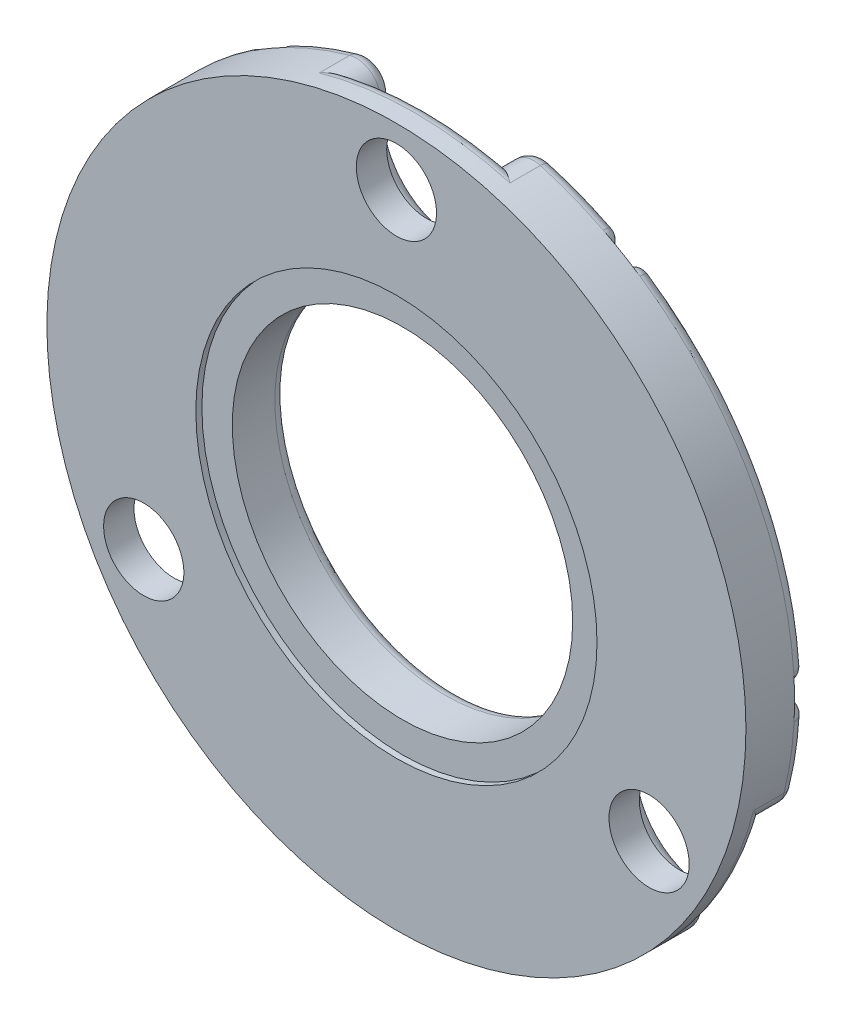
ISO-10303-21;
HEADER;
FILE_DESCRIPTION(('STEP AP214'),'2;1');
FILE_NAME('part.step','',(''),(''),'','','');
FILE_SCHEMA(('AUTOMOTIVE_DESIGN { 1 0 10303 214 1 1 1 1 }'));
ENDSEC;
DATA;
#1=APPLICATION_CONTEXT('core data for automotive mechanical design processes');
#2=APPLICATION_PROTOCOL_DEFINITION('international standard','automotive_design',2000,#1);
#3=PRODUCT_CONTEXT('',#1,'mechanical');
#4=PRODUCT('Part','Part','',(#3));
#5=PRODUCT_RELATED_PRODUCT_CATEGORY('part','',(#4));
#6=PRODUCT_DEFINITION_FORMATION('','',#4);
#7=PRODUCT_DEFINITION_CONTEXT('part definition',#1,'design');
#8=PRODUCT_DEFINITION('design','',#6,#7);
#9=PRODUCT_DEFINITION_SHAPE('','',#8);
#10=(LENGTH_UNIT() NAMED_UNIT(*) SI_UNIT(.MILLI.,.METRE.));
#11=(NAMED_UNIT(*) PLANE_ANGLE_UNIT() SI_UNIT($,.RADIAN.));
#12=(NAMED_UNIT(*) SI_UNIT($,.STERADIAN.) SOLID_ANGLE_UNIT());
#13=UNCERTAINTY_MEASURE_WITH_UNIT(LENGTH_MEASURE(1.E-05),#10,'distance_accuracy_value','');
#14=(GEOMETRIC_REPRESENTATION_CONTEXT(3) GLOBAL_UNCERTAINTY_ASSIGNED_CONTEXT((#13)) GLOBAL_UNIT_ASSIGNED_CONTEXT((#10,
#11,#12)) REPRESENTATION_CONTEXT('',''));
#15=CARTESIAN_POINT('',(0.,0.,0.));
#16=DIRECTION('',(0.,0.,1.));
#17=DIRECTION('',(1.,0.,0.));
#18=AXIS2_PLACEMENT_3D('',#15,#16,#17);
#19=CARTESIAN_POINT('',(0.,0.,5.));
#20=DIRECTION('',(0.,0.,-1.));
#21=DIRECTION('',(-1.,0.,0.));
#22=AXIS2_PLACEMENT_3D('',#19,#20,#21);
#23=CYLINDRICAL_SURFACE('',#22,14.);
#24=CARTESIAN_POINT('',(0.,0.,1.));
#25=DIRECTION('',(0.,0.,1.));
#26=DIRECTION('',(1.,0.,0.));
#27=AXIS2_PLACEMENT_3D('',#24,#25,#26);
#28=CIRCLE('',#27,14.);
#29=CARTESIAN_POINT('',(14.,0.,1.));
#30=VERTEX_POINT('',#29);
#31=EDGE_CURVE('E438',#30,#30,#28,.F.);
#32=ORIENTED_EDGE('',*,*,#31,.T.);
#33=EDGE_LOOP('',(#32));
#34=FACE_BOUND('',#33,.T.);
#35=CARTESIAN_POINT('',(0.,0.,4.5));
#36=DIRECTION('',(0.,0.,1.));
#37=DIRECTION('',(1.,0.,0.));
#38=AXIS2_PLACEMENT_3D('',#35,#36,#37);
#39=CIRCLE('',#38,14.);
#40=CARTESIAN_POINT('',(14.,0.,4.5));
#41=VERTEX_POINT('',#40);
#42=EDGE_CURVE('E58',#41,#41,#39,.T.);
#43=ORIENTED_EDGE('',*,*,#42,.T.);
#44=EDGE_LOOP('',(#43));
#45=FACE_BOUND('',#44,.T.);
#46=ADVANCED_FACE('F54',(#34,#45),#23,.F.);
#47=CARTESIAN_POINT('',(0.,0.,0.));
#48=DIRECTION('',(0.,0.,1.));
#49=DIRECTION('',(1.,0.,0.));
#50=AXIS2_PLACEMENT_3D('',#47,#48,#49);
#51=PLANE('',#50);
#52=CARTESIAN_POINT('',(0.,0.,0.));
#53=DIRECTION('',(0.,0.,1.));
#54=DIRECTION('',(1.,0.,0.));
#55=AXIS2_PLACEMENT_3D('',#52,#53,#54);
#56=CIRCLE('',#55,27.75);
#57=CARTESIAN_POINT('',(12.2085698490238,-24.9201388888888,0.));
#58=VERTEX_POINT('',#57);
#59=CARTESIAN_POINT('',(-12.2085698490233,-24.920138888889,0.));
#60=VERTEX_POINT('',#59);
#61=EDGE_CURVE('E376',#58,#60,#56,.F.);
#62=ORIENTED_EDGE('',*,*,#61,.T.);
#63=CARTESIAN_POINT('',(4.23272528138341E-13,-45.,0.));
#64=DIRECTION('',(0.,0.,1.));
#65=DIRECTION('',(1.,0.,0.));
#66=AXIS2_PLACEMENT_3D('',#63,#64,#65);
#67=CIRCLE('',#66,23.5);
#68=EDGE_CURVE('E587',#60,#58,#67,.F.);
#69=ORIENTED_EDGE('',*,*,#68,.T.);
#70=EDGE_LOOP('',(#62,#69));
#71=FACE_BOUND('',#70,.T.);
#72=ADVANCED_FACE('F805',(#71),#51,.F.);
#73=CARTESIAN_POINT('',(0.,0.,1.));
#74=DIRECTION('',(0.,0.,1.));
#75=DIRECTION('',(1.,0.,0.));
#76=AXIS2_PLACEMENT_3D('',#73,#74,#75);
#77=TOROIDAL_SURFACE('',#76,27.75,1.);
#78=CARTESIAN_POINT('',(0.,0.,1.));
#79=DIRECTION('',(0.,0.,1.));
#80=DIRECTION('',(1.,0.,0.));
#81=AXIS2_PLACEMENT_3D('',#78,#79,#80);
#82=CIRCLE('',#81,28.75);
#83=CARTESIAN_POINT('',(-12.6485183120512,-25.818161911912,1.));
#84=VERTEX_POINT('',#83);
#85=CARTESIAN_POINT('',(12.6485183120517,-25.8181619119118,1.));
#86=VERTEX_POINT('',#85);
#87=EDGE_CURVE('E969',#84,#86,#82,.T.);
#88=ORIENTED_EDGE('',*,*,#87,.F.);
#89=CARTESIAN_POINT('',(-12.2085698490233,-24.920138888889,1.));
#90=DIRECTION('',(0.898023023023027,-0.439948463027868,0.));
#91=DIRECTION('',(0.439948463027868,0.898023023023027,0.));
#92=AXIS2_PLACEMENT_3D('',#89,#90,#91);
#93=CIRCLE('',#92,1.);
#94=EDGE_CURVE('E557',#84,#60,#93,.T.);
#95=ORIENTED_EDGE('',*,*,#94,.T.);
#96=ORIENTED_EDGE('',*,*,#61,.F.);
#97=CARTESIAN_POINT('',(12.2085698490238,-24.9201388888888,1.));
#98=DIRECTION('',(0.898023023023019,0.439948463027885,0.));
#99=DIRECTION('',(-0.439948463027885,0.898023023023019,0.));
#100=AXIS2_PLACEMENT_3D('',#97,#98,#99);
#101=CIRCLE('',#100,1.);
#102=EDGE_CURVE('E518',#58,#86,#101,.F.);
#103=ORIENTED_EDGE('',*,*,#102,.T.);
#104=EDGE_LOOP('',(#88,#95,#96,#103));
#105=FACE_BOUND('',#104,.T.);
#106=ADVANCED_FACE('F811',(#105),#77,.T.);
#107=CARTESIAN_POINT('',(15.6896542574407,-24.091435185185,1.));
#108=VERTEX_POINT('',#107);
#109=CARTESIAN_POINT('',(20.0331623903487,-20.6212246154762,1.));
#110=VERTEX_POINT('',#109);
#111=EDGE_CURVE('E409',#108,#110,#82,.T.);
#112=ORIENTED_EDGE('',*,*,#111,.F.);
#113=CARTESIAN_POINT('',(15.1439271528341,-23.2534722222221,1.));
#114=DIRECTION('',(0.837962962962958,0.545727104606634,0.));
#115=DIRECTION('',(-0.545727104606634,0.837962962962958,0.));
#116=AXIS2_PLACEMENT_3D('',#113,#114,#115);
#117=CIRCLE('',#116,1.);
#118=CARTESIAN_POINT('',(15.1439271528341,-23.2534722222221,0.));
#119=VERTEX_POINT('',#118);
#120=EDGE_CURVE('E563',#108,#119,#117,.T.);
#121=ORIENTED_EDGE('',*,*,#120,.T.);
#122=CARTESIAN_POINT('',(19.3363567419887,-19.9039646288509,0.));
#123=VERTEX_POINT('',#122);
#124=EDGE_CURVE('E372',#123,#119,#56,.F.);
#125=ORIENTED_EDGE('',*,*,#124,.F.);
#126=CARTESIAN_POINT('',(19.3363567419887,-19.9039646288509,1.));
#127=DIRECTION('',(0.717259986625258,0.696805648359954,0.));
#128=DIRECTION('',(-0.696805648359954,0.717259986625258,0.));
#129=AXIS2_PLACEMENT_3D('',#126,#127,#128);
#130=CIRCLE('',#129,1.);
#131=EDGE_CURVE('E542',#110,#123,#130,.T.);
#132=ORIENTED_EDGE('',*,*,#131,.F.);
#133=EDGE_LOOP('',(#112,#121,#125,#132));
#134=FACE_BOUND('',#133,.T.);
#135=ADVANCED_FACE('F926',(#134),#77,.T.);
#136=CARTESIAN_POINT('',(0.,0.,0.));
#137=DIRECTION('',(0.,0.,1.));
#138=DIRECTION('',(1.,0.,0.));
#139=AXIS2_PLACEMENT_3D('',#136,#137,#138);
#140=CIRCLE('',#139,27.75);
#141=CARTESIAN_POINT('',(-27.6857582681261,1.88713781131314,0.));
#142=VERTEX_POINT('',#141);
#143=CARTESIAN_POINT('',(-15.4771884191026,23.0330010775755,0.));
#144=VERTEX_POINT('',#143);
#145=EDGE_CURVE('E365',#142,#144,#140,.F.);
#146=ORIENTED_EDGE('',*,*,#145,.T.);
#147=CARTESIAN_POINT('',(-38.9711431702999,22.4999999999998,0.));
#148=DIRECTION('',(0.,0.,1.));
#149=DIRECTION('',(1.,0.,0.));
#150=AXIS2_PLACEMENT_3D('',#147,#148,#149);
#151=CIRCLE('',#150,23.5);
#152=EDGE_CURVE('E595',#144,#142,#151,.F.);
#153=ORIENTED_EDGE('',*,*,#152,.T.);
#154=EDGE_LOOP('',(#146,#153));
#155=FACE_BOUND('',#154,.T.);
#156=ADVANCED_FACE('F814',(#155),#51,.F.);
#157=CARTESIAN_POINT('',(0.,0.,1.));
#158=DIRECTION('',(0.,0.,1.));
#159=DIRECTION('',(1.,0.,0.));
#160=AXIS2_PLACEMENT_3D('',#157,#158,#159);
#161=TOROIDAL_SURFACE('',#160,27.75,1.);
#162=CARTESIAN_POINT('',(0.,0.,1.));
#163=DIRECTION('',(0.,0.,1.));
#164=DIRECTION('',(1.,0.,0.));
#165=AXIS2_PLACEMENT_3D('',#162,#163,#164);
#166=CIRCLE('',#165,28.75);
#167=CARTESIAN_POINT('',(-16.0349249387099,23.8630191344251,1.));
#168=VERTEX_POINT('',#167);
#169=CARTESIAN_POINT('',(-28.6834432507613,1.95514277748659,1.));
#170=VERTEX_POINT('',#169);
#171=EDGE_CURVE('E411',#168,#170,#166,.T.);
#172=ORIENTED_EDGE('',*,*,#171,.F.);
#173=CARTESIAN_POINT('',(-15.4771884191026,23.0330010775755,1.));
#174=DIRECTION('',(-0.830018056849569,-0.557736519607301,0.));
#175=DIRECTION('',(0.557736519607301,-0.830018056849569,0.));
#176=AXIS2_PLACEMENT_3D('',#173,#174,#175);
#177=CIRCLE('',#176,1.);
#178=EDGE_CURVE('E573',#168,#144,#177,.T.);
#179=ORIENTED_EDGE('',*,*,#178,.T.);
#180=ORIENTED_EDGE('',*,*,#145,.F.);
#181=CARTESIAN_POINT('',(-27.6857582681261,1.88713781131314,1.));
#182=DIRECTION('',(-0.0680049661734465,-0.997684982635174,0.));
#183=DIRECTION('',(0.997684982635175,-0.0680049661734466,0.));
#184=AXIS2_PLACEMENT_3D('',#181,#182,#183);
#185=CIRCLE('',#184,1.);
#186=EDGE_CURVE('E570',#142,#170,#185,.F.);
#187=ORIENTED_EDGE('',*,*,#186,.T.);
#188=EDGE_LOOP('',(#172,#179,#180,#187));
#189=FACE_BOUND('',#188,.T.);
#190=ADVANCED_FACE('F905',(#189),#161,.T.);
#191=CARTESIAN_POINT('',(-12.5661340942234,24.7417617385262,0.));
#192=VERTEX_POINT('',#191);
#193=CARTESIAN_POINT('',(-7.56916063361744,26.6977584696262,0.));
#194=VERTEX_POINT('',#193);
#195=EDGE_CURVE('E360',#192,#194,#140,.F.);
#196=ORIENTED_EDGE('',*,*,#195,.F.);
#197=CARTESIAN_POINT('',(-12.5661340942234,24.7417617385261,1.));
#198=DIRECTION('',(-0.891595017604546,-0.452833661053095,0.));
#199=DIRECTION('',(0.452833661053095,-0.891595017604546,0.));
#200=AXIS2_PLACEMENT_3D('',#197,#198,#199);
#201=CIRCLE('',#200,1.);
#202=CARTESIAN_POINT('',(-13.0189677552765,25.6333567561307,1.));
#203=VERTEX_POINT('',#202);
#204=EDGE_CURVE('E565',#192,#203,#201,.F.);
#205=ORIENTED_EDGE('',*,*,#204,.T.);
#206=CARTESIAN_POINT('',(-7.84192317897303,27.659839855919,1.));
#207=VERTEX_POINT('',#206);
#208=EDGE_CURVE('E406',#207,#203,#166,.T.);
#209=ORIENTED_EDGE('',*,*,#208,.F.);
#210=CARTESIAN_POINT('',(-7.56916063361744,26.6977584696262,1.));
#211=DIRECTION('',(0.962081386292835,0.272762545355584,0.));
#212=DIRECTION('',(-0.272762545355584,0.962081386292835,0.));
#213=AXIS2_PLACEMENT_3D('',#210,#211,#212);
#214=CIRCLE('',#213,1.);
#215=EDGE_CURVE('E533',#194,#207,#214,.T.);
#216=ORIENTED_EDGE('',*,*,#215,.F.);
#217=EDGE_LOOP('',(#196,#205,#209,#216));
#218=FACE_BOUND('',#217,.T.);
#219=ADVANCED_FACE('F719',(#218),#161,.T.);
#220=CARTESIAN_POINT('',(0.,0.,0.));
#221=DIRECTION('',(0.,0.,1.));
#222=DIRECTION('',(1.,0.,0.));
#223=AXIS2_PLACEMENT_3D('',#220,#221,#222);
#224=CIRCLE('',#223,27.75);
#225=CARTESIAN_POINT('',(15.4771884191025,23.0330010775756,0.));
#226=VERTEX_POINT('',#225);
#227=CARTESIAN_POINT('',(27.6857582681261,1.88713781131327,0.));
#228=VERTEX_POINT('',#227);
#229=EDGE_CURVE('E387',#226,#228,#224,.F.);
#230=ORIENTED_EDGE('',*,*,#229,.T.);
#231=CARTESIAN_POINT('',(38.9711431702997,22.5,0.));
#232=DIRECTION('',(0.,0.,1.));
#233=DIRECTION('',(1.,0.,0.));
#234=AXIS2_PLACEMENT_3D('',#231,#232,#233);
#235=CIRCLE('',#234,23.5);
#236=EDGE_CURVE('E597',#228,#226,#235,.F.);
#237=ORIENTED_EDGE('',*,*,#236,.T.);
#238=EDGE_LOOP('',(#230,#237));
#239=FACE_BOUND('',#238,.T.);
#240=ADVANCED_FACE('F821',(#239),#51,.F.);
#241=CARTESIAN_POINT('',(0.,0.,1.));
#242=DIRECTION('',(0.,0.,1.));
#243=DIRECTION('',(1.,0.,0.));
#244=AXIS2_PLACEMENT_3D('',#241,#242,#243);
#245=TOROIDAL_SURFACE('',#244,27.75,1.);
#246=CARTESIAN_POINT('',(0.,0.,1.));
#247=DIRECTION('',(0.,0.,1.));
#248=DIRECTION('',(1.,0.,0.));
#249=AXIS2_PLACEMENT_3D('',#246,#247,#248);
#250=CIRCLE('',#249,28.75);
#251=CARTESIAN_POINT('',(28.6834432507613,1.95514277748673,1.));
#252=VERTEX_POINT('',#251);
#253=CARTESIAN_POINT('',(16.0349249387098,23.8630191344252,1.));
#254=VERTEX_POINT('',#253);
#255=EDGE_CURVE('E420',#252,#254,#250,.T.);
#256=ORIENTED_EDGE('',*,*,#255,.F.);
#257=CARTESIAN_POINT('',(27.6857582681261,1.88713781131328,1.));
#258=DIRECTION('',(-0.0680049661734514,0.997684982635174,0.));
#259=DIRECTION('',(-0.997684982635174,-0.0680049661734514,0.));
#260=AXIS2_PLACEMENT_3D('',#257,#258,#259);
#261=CIRCLE('',#260,1.);
#262=EDGE_CURVE('E584',#252,#228,#261,.T.);
#263=ORIENTED_EDGE('',*,*,#262,.T.);
#264=ORIENTED_EDGE('',*,*,#229,.F.);
#265=CARTESIAN_POINT('',(15.4771884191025,23.0330010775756,1.));
#266=DIRECTION('',(-0.830018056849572,0.557736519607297,0.));
#267=DIRECTION('',(-0.557736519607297,-0.830018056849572,0.));
#268=AXIS2_PLACEMENT_3D('',#265,#266,#267);
#269=CIRCLE('',#268,1.);
#270=EDGE_CURVE('E581',#226,#254,#269,.F.);
#271=ORIENTED_EDGE('',*,*,#270,.T.);
#272=EDGE_LOOP('',(#256,#263,#264,#271));
#273=FACE_BOUND('',#272,.T.);
#274=ADVANCED_FACE('F670',(#273),#245,.T.);
#275=CARTESIAN_POINT('',(13.0189677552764,25.6333567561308,1.));
#276=VERTEX_POINT('',#275);
#277=CARTESIAN_POINT('',(7.84192317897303,27.659839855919,1.));
#278=VERTEX_POINT('',#277);
#279=EDGE_CURVE('E415',#276,#278,#250,.T.);
#280=ORIENTED_EDGE('',*,*,#279,.F.);
#281=CARTESIAN_POINT('',(12.5661340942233,24.7417617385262,1.));
#282=DIRECTION('',(-0.891595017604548,0.452833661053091,0.));
#283=DIRECTION('',(-0.452833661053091,-0.891595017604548,0.));
#284=AXIS2_PLACEMENT_3D('',#281,#282,#283);
#285=CIRCLE('',#284,1.);
#286=CARTESIAN_POINT('',(12.5661340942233,24.7417617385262,0.));
#287=VERTEX_POINT('',#286);
#288=EDGE_CURVE('E579',#276,#287,#285,.T.);
#289=ORIENTED_EDGE('',*,*,#288,.T.);
#290=CARTESIAN_POINT('',(7.56916063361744,26.6977584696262,0.));
#291=VERTEX_POINT('',#290);
#292=EDGE_CURVE('E383',#291,#287,#224,.F.);
#293=ORIENTED_EDGE('',*,*,#292,.F.);
#294=CARTESIAN_POINT('',(7.56916063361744,26.6977584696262,1.));
#295=DIRECTION('',(-0.962081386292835,0.272762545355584,0.));
#296=DIRECTION('',(-0.272762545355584,-0.962081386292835,0.));
#297=AXIS2_PLACEMENT_3D('',#294,#295,#296);
#298=CIRCLE('',#297,1.);
#299=EDGE_CURVE('E519',#278,#291,#298,.T.);
#300=ORIENTED_EDGE('',*,*,#299,.F.);
#301=EDGE_LOOP('',(#280,#289,#293,#300));
#302=FACE_BOUND('',#301,.T.);
#303=ADVANCED_FACE('F694',(#302),#245,.T.);
#304=CARTESIAN_POINT('',(0.,0.,0.));
#305=DIRECTION('',(0.,0.,1.));
#306=DIRECTION('',(1.,0.,0.));
#307=AXIS2_PLACEMENT_3D('',#304,#305,#306);
#308=CIRCLE('',#307,15.);
#309=CARTESIAN_POINT('',(15.,0.,0.));
#310=VERTEX_POINT('',#309);
#311=EDGE_CURVE('E390',#310,#310,#308,.T.);
#312=ORIENTED_EDGE('',*,*,#311,.T.);
#313=EDGE_LOOP('',(#312));
#314=FACE_BOUND('',#313,.T.);
#315=ORIENTED_EDGE('',*,*,#124,.T.);
#316=CARTESIAN_POINT('',(4.23272528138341E-13,-45.,0.));
#317=DIRECTION('',(0.,0.,1.));
#318=DIRECTION('',(1.,0.,0.));
#319=AXIS2_PLACEMENT_3D('',#316,#317,#318);
#320=CIRCLE('',#319,26.5);
#321=CARTESIAN_POINT('',(-15.1439271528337,-23.2534722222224,0.));
#322=VERTEX_POINT('',#321);
#323=EDGE_CURVE('E593',#119,#322,#320,.T.);
#324=ORIENTED_EDGE('',*,*,#323,.T.);
#325=CARTESIAN_POINT('',(-19.3363567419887,-19.9039646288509,0.));
#326=VERTEX_POINT('',#325);
#327=EDGE_CURVE('E371',#322,#326,#56,.F.);
#328=ORIENTED_EDGE('',*,*,#327,.T.);
#329=CARTESIAN_POINT('',(-18.6395510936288,-19.1867046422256,0.));
#330=DIRECTION('',(0.,0.,1.));
#331=DIRECTION('',(1.,0.,0.));
#332=AXIS2_PLACEMENT_3D('',#329,#330,#331);
#333=CIRCLE('',#332,1.);
#334=CARTESIAN_POINT('',(-18.9255589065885,-18.2284773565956,0.));
#335=VERTEX_POINT('',#334);
#336=EDGE_CURVE('E369',#326,#335,#333,.F.);
#337=ORIENTED_EDGE('',*,*,#336,.T.);
#338=CARTESIAN_POINT('',(-20.7846096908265,-12.,0.));
#339=DIRECTION('',(0.,0.,1.));
#340=DIRECTION('',(1.,0.,0.));
#341=AXIS2_PLACEMENT_3D('',#338,#339,#340);
#342=CIRCLE('',#341,6.5);
#343=CARTESIAN_POINT('',(-25.2491039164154,-7.27577611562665,0.));
#344=VERTEX_POINT('',#343);
#345=EDGE_CURVE('E367',#335,#344,#342,.T.);
#346=ORIENTED_EDGE('',*,*,#345,.T.);
#347=CARTESIAN_POINT('',(-25.9359491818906,-6.54897244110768,0.));
#348=DIRECTION('',(0.,0.,1.));
#349=DIRECTION('',(1.,0.,0.));
#350=AXIS2_PLACEMENT_3D('',#347,#348,#349);
#351=CIRCLE('',#350,1.);
#352=CARTESIAN_POINT('',(-26.9055173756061,-6.79379384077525,0.));
#353=VERTEX_POINT('',#352);
#354=EDGE_CURVE('E364',#344,#353,#351,.F.);
#355=ORIENTED_EDGE('',*,*,#354,.T.);
#356=CARTESIAN_POINT('',(-27.7100612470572,-1.48828951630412,0.));
#357=VERTEX_POINT('',#356);
#358=EDGE_CURVE('E361',#353,#357,#140,.F.);
#359=ORIENTED_EDGE('',*,*,#358,.T.);
#360=CARTESIAN_POINT('',(-38.9711431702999,22.4999999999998,0.));
#361=DIRECTION('',(0.,0.,1.));
#362=DIRECTION('',(1.,0.,0.));
#363=AXIS2_PLACEMENT_3D('',#360,#361,#362);
#364=CIRCLE('',#363,26.5);
#365=EDGE_CURVE('E591',#357,#192,#364,.T.);
#366=ORIENTED_EDGE('',*,*,#365,.T.);
#367=ORIENTED_EDGE('',*,*,#195,.T.);
#368=CARTESIAN_POINT('',(-7.29639808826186,25.7356770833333,0.));
#369=DIRECTION('',(0.,0.,1.));
#370=DIRECTION('',(1.,0.,0.));
#371=AXIS2_PLACEMENT_3D('',#368,#369,#370);
#372=CIRCLE('',#371,1.);
#373=CARTESIAN_POINT('',(-6.32354500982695,25.5042534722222,0.));
#374=VERTEX_POINT('',#373);
#375=EDGE_CURVE('E358',#194,#374,#372,.F.);
#376=ORIENTED_EDGE('',*,*,#375,.T.);
#377=CARTESIAN_POINT('',(0.,24.,0.));
#378=DIRECTION('',(0.,0.,1.));
#379=DIRECTION('',(1.,0.,0.));
#380=AXIS2_PLACEMENT_3D('',#377,#378,#379);
#381=CIRCLE('',#380,6.5);
#382=CARTESIAN_POINT('',(6.32354500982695,25.5042534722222,0.));
#383=VERTEX_POINT('',#382);
#384=EDGE_CURVE('E356',#374,#383,#381,.T.);
#385=ORIENTED_EDGE('',*,*,#384,.T.);
#386=CARTESIAN_POINT('',(7.29639808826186,25.7356770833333,0.));
#387=DIRECTION('',(0.,0.,1.));
#388=DIRECTION('',(1.,0.,0.));
#389=AXIS2_PLACEMENT_3D('',#386,#387,#388);
#390=CIRCLE('',#389,1.);
#391=EDGE_CURVE('E386',#383,#291,#390,.F.);
#392=ORIENTED_EDGE('',*,*,#391,.T.);
#393=ORIENTED_EDGE('',*,*,#292,.T.);
#394=CARTESIAN_POINT('',(38.9711431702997,22.5,0.));
#395=DIRECTION('',(0.,0.,1.));
#396=DIRECTION('',(1.,0.,0.));
#397=AXIS2_PLACEMENT_3D('',#394,#395,#396);
#398=CIRCLE('',#397,26.5);
#399=CARTESIAN_POINT('',(27.7100612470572,-1.48828951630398,0.));
#400=VERTEX_POINT('',#399);
#401=EDGE_CURVE('E589',#287,#400,#398,.T.);
#402=ORIENTED_EDGE('',*,*,#401,.T.);
#403=CARTESIAN_POINT('',(26.9055173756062,-6.79379384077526,0.));
#404=VERTEX_POINT('',#403);
#405=EDGE_CURVE('E382',#400,#404,#224,.F.);
#406=ORIENTED_EDGE('',*,*,#405,.T.);
#407=CARTESIAN_POINT('',(25.9359491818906,-6.54897244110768,0.));
#408=DIRECTION('',(0.,0.,1.));
#409=DIRECTION('',(1.,0.,0.));
#410=AXIS2_PLACEMENT_3D('',#407,#408,#409);
#411=CIRCLE('',#410,1.);
#412=CARTESIAN_POINT('',(25.2491039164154,-7.27577611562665,0.));
#413=VERTEX_POINT('',#412);
#414=EDGE_CURVE('E380',#404,#413,#411,.F.);
#415=ORIENTED_EDGE('',*,*,#414,.T.);
#416=CARTESIAN_POINT('',(20.7846096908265,-12.,0.));
#417=DIRECTION('',(0.,0.,1.));
#418=DIRECTION('',(1.,0.,0.));
#419=AXIS2_PLACEMENT_3D('',#416,#417,#418);
#420=CIRCLE('',#419,6.5);
#421=CARTESIAN_POINT('',(18.9255589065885,-18.2284773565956,0.));
#422=VERTEX_POINT('',#421);
#423=EDGE_CURVE('E378',#413,#422,#420,.T.);
#424=ORIENTED_EDGE('',*,*,#423,.T.);
#425=CARTESIAN_POINT('',(18.6395510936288,-19.1867046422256,0.));
#426=DIRECTION('',(0.,0.,1.));
#427=DIRECTION('',(1.,0.,0.));
#428=AXIS2_PLACEMENT_3D('',#425,#426,#427);
#429=CIRCLE('',#428,1.);
#430=EDGE_CURVE('E375',#422,#123,#429,.F.);
#431=ORIENTED_EDGE('',*,*,#430,.T.);
#432=EDGE_LOOP('',(#315,#324,#328,#337,#346,#355,#359,#366,#367,#376,#385,#392,#393,#402,#406,
#415,#424,#431));
#433=FACE_BOUND('',#432,.T.);
#434=ADVANCED_FACE('F698',(#314,#433),#51,.F.);
#435=CARTESIAN_POINT('',(0.,0.,5.));
#436=DIRECTION('',(0.,0.,1.));
#437=DIRECTION('',(1.,0.,0.));
#438=AXIS2_PLACEMENT_3D('',#435,#436,#437);
#439=PLANE('',#438);
#440=CARTESIAN_POINT('',(0.,0.,5.));
#441=DIRECTION('',(0.,0.,1.));
#442=DIRECTION('',(1.,0.,0.));
#443=AXIS2_PLACEMENT_3D('',#440,#441,#442);
#444=CIRCLE('',#443,16.5);
#445=CARTESIAN_POINT('',(16.5,0.,5.));
#446=VERTEX_POINT('',#445);
#447=EDGE_CURVE('E987',#446,#446,#444,.T.);
#448=ORIENTED_EDGE('',*,*,#447,.F.);
#449=EDGE_LOOP('',(#448));
#450=FACE_BOUND('',#449,.T.);
#451=CARTESIAN_POINT('',(0.,24.,5.));
#452=DIRECTION('',(0.,0.,-1.));
#453=DIRECTION('',(-1.,0.,0.));
#454=AXIS2_PLACEMENT_3D('',#451,#452,#453);
#455=CIRCLE('',#454,3.3);
#456=CARTESIAN_POINT('',(-3.3,24.,5.));
#457=VERTEX_POINT('',#456);
#458=EDGE_CURVE('E770',#457,#457,#455,.T.);
#459=ORIENTED_EDGE('',*,*,#458,.T.);
#460=EDGE_LOOP('',(#459));
#461=FACE_BOUND('',#460,.T.);
#462=CARTESIAN_POINT('',(-20.7846096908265,-12.,5.));
#463=DIRECTION('',(0.,0.,-1.));
#464=DIRECTION('',(-1.,0.,0.));
#465=AXIS2_PLACEMENT_3D('',#462,#463,#464);
#466=CIRCLE('',#465,3.3);
#467=CARTESIAN_POINT('',(-24.0846096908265,-12.,5.));
#468=VERTEX_POINT('',#467);
#469=EDGE_CURVE('E325',#468,#468,#466,.T.);
#470=ORIENTED_EDGE('',*,*,#469,.T.);
#471=EDGE_LOOP('',(#470));
#472=FACE_BOUND('',#471,.T.);
#473=CARTESIAN_POINT('',(20.7846096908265,-12.,5.));
#474=DIRECTION('',(0.,0.,-1.));
#475=DIRECTION('',(-1.,0.,0.));
#476=AXIS2_PLACEMENT_3D('',#473,#474,#475);
#477=CIRCLE('',#476,3.3);
#478=CARTESIAN_POINT('',(17.4846096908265,-12.,5.));
#479=VERTEX_POINT('',#478);
#480=EDGE_CURVE('E727',#479,#479,#477,.T.);
#481=ORIENTED_EDGE('',*,*,#480,.T.);
#482=EDGE_LOOP('',(#481));
#483=FACE_BOUND('',#482,.T.);
#484=CARTESIAN_POINT('',(0.,0.,5.));
#485=DIRECTION('',(0.,0.,1.));
#486=DIRECTION('',(1.,0.,0.));
#487=AXIS2_PLACEMENT_3D('',#484,#485,#486);
#488=CIRCLE('',#487,28.75);
#489=CARTESIAN_POINT('',(28.75,0.,5.));
#490=VERTEX_POINT('',#489);
#491=EDGE_CURVE('E724',#490,#490,#488,.T.);
#492=ORIENTED_EDGE('',*,*,#491,.T.);
#493=EDGE_LOOP('',(#492));
#494=FACE_BOUND('',#493,.T.);
#495=ADVANCED_FACE('F785',(#450,#461,#472,#483,#494),#439,.T.);
#496=CARTESIAN_POINT('',(0.,0.,5.));
#497=DIRECTION('',(0.,0.,-1.));
#498=DIRECTION('',(-1.,0.,0.));
#499=AXIS2_PLACEMENT_3D('',#496,#497,#498);
#500=CYLINDRICAL_SURFACE('',#499,28.75);
#501=ORIENTED_EDGE('',*,*,#491,.F.);
#502=EDGE_LOOP('',(#501));
#503=FACE_BOUND('',#502,.T.);
#504=DIRECTION('',(0.,0.,-1.));
#505=VECTOR('',#504,1.);
#506=CARTESIAN_POINT('',(27.8750855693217,-7.03861524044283,5.));
#507=LINE('',#506,#505);
#508=CARTESIAN_POINT('',(27.8750855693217,-7.03861524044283,3.5));
#509=VERTEX_POINT('',#508);
#510=CARTESIAN_POINT('',(27.8750855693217,-7.03861524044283,1.));
#511=VERTEX_POINT('',#510);
#512=EDGE_CURVE('E735',#509,#511,#507,.T.);
#513=ORIENTED_EDGE('',*,*,#512,.T.);
#514=CARTESIAN_POINT('',(28.7086220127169,-1.54192157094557,1.));
#515=VERTEX_POINT('',#514);
#516=EDGE_CURVE('E417',#511,#515,#250,.T.);
#517=ORIENTED_EDGE('',*,*,#516,.T.);
#518=EDGE_CURVE('E72',#515,#252,#250,.T.);
#519=ORIENTED_EDGE('',*,*,#518,.T.);
#520=ORIENTED_EDGE('',*,*,#255,.T.);
#521=EDGE_CURVE('E675',#254,#276,#250,.T.);
#522=ORIENTED_EDGE('',*,*,#521,.T.);
#523=ORIENTED_EDGE('',*,*,#279,.T.);
#524=DIRECTION('',(0.,0.,-1.));
#525=VECTOR('',#524,1.);
#526=CARTESIAN_POINT('',(7.84192317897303,27.659839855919,5.));
#527=LINE('',#526,#525);
#528=CARTESIAN_POINT('',(7.84192317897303,27.659839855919,3.5));
#529=VERTEX_POINT('',#528);
#530=EDGE_CURVE('E678',#278,#529,#527,.F.);
#531=ORIENTED_EDGE('',*,*,#530,.T.);
#532=CARTESIAN_POINT('',(0.,0.,3.5));
#533=DIRECTION('',(0.,0.,1.));
#534=DIRECTION('',(1.,0.,0.));
#535=AXIS2_PLACEMENT_3D('',#532,#533,#534);
#536=CIRCLE('',#535,28.75);
#537=CARTESIAN_POINT('',(-7.84192317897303,27.659839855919,3.5));
#538=VERTEX_POINT('',#537);
#539=EDGE_CURVE('E396',#529,#538,#536,.T.);
#540=ORIENTED_EDGE('',*,*,#539,.T.);
#541=DIRECTION('',(0.,0.,-1.));
#542=VECTOR('',#541,1.);
#543=CARTESIAN_POINT('',(-7.84192317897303,27.659839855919,5.));
#544=LINE('',#543,#542);
#545=EDGE_CURVE('E687',#538,#207,#544,.T.);
#546=ORIENTED_EDGE('',*,*,#545,.T.);
#547=ORIENTED_EDGE('',*,*,#208,.T.);
#548=EDGE_CURVE('E410',#203,#168,#166,.T.);
#549=ORIENTED_EDGE('',*,*,#548,.T.);
#550=ORIENTED_EDGE('',*,*,#171,.T.);
#551=CARTESIAN_POINT('',(-28.7086220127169,-1.54192157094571,1.));
#552=VERTEX_POINT('',#551);
#553=EDGE_CURVE('E889',#170,#552,#166,.T.);
#554=ORIENTED_EDGE('',*,*,#553,.T.);
#555=CARTESIAN_POINT('',(-27.8750855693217,-7.03861524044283,1.));
#556=VERTEX_POINT('',#555);
#557=EDGE_CURVE('E405',#552,#556,#166,.T.);
#558=ORIENTED_EDGE('',*,*,#557,.T.);
#559=DIRECTION('',(0.,0.,-1.));
#560=VECTOR('',#559,1.);
#561=CARTESIAN_POINT('',(-27.8750855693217,-7.03861524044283,5.));
#562=LINE('',#561,#560);
#563=CARTESIAN_POINT('',(-27.8750855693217,-7.03861524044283,3.5));
#564=VERTEX_POINT('',#563);
#565=EDGE_CURVE('E733',#556,#564,#562,.F.);
#566=ORIENTED_EDGE('',*,*,#565,.T.);
#567=CARTESIAN_POINT('',(0.,0.,3.5));
#568=DIRECTION('',(0.,0.,1.));
#569=DIRECTION('',(1.,0.,0.));
#570=AXIS2_PLACEMENT_3D('',#567,#568,#569);
#571=CIRCLE('',#570,28.75);
#572=CARTESIAN_POINT('',(-20.0331623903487,-20.6212246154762,3.5));
#573=VERTEX_POINT('',#572);
#574=EDGE_CURVE('E399',#564,#573,#571,.T.);
#575=ORIENTED_EDGE('',*,*,#574,.T.);
#576=DIRECTION('',(0.,0.,-1.));
#577=VECTOR('',#576,1.);
#578=CARTESIAN_POINT('',(-20.0331623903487,-20.6212246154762,5.));
#579=LINE('',#578,#577);
#580=CARTESIAN_POINT('',(-20.0331623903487,-20.6212246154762,1.));
#581=VERTEX_POINT('',#580);
#582=EDGE_CURVE('E686',#573,#581,#579,.T.);
#583=ORIENTED_EDGE('',*,*,#582,.T.);
#584=CARTESIAN_POINT('',(-15.6896542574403,-24.0914351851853,1.));
#585=VERTEX_POINT('',#584);
#586=EDGE_CURVE('E412',#581,#585,#82,.T.);
#587=ORIENTED_EDGE('',*,*,#586,.T.);
#588=EDGE_CURVE('E416',#585,#84,#82,.T.);
#589=ORIENTED_EDGE('',*,*,#588,.T.);
#590=ORIENTED_EDGE('',*,*,#87,.T.);
#591=EDGE_CURVE('E970',#86,#108,#82,.T.);
#592=ORIENTED_EDGE('',*,*,#591,.T.);
#593=ORIENTED_EDGE('',*,*,#111,.T.);
#594=DIRECTION('',(0.,0.,-1.));
#595=VECTOR('',#594,1.);
#596=CARTESIAN_POINT('',(20.0331623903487,-20.6212246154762,5.));
#597=LINE('',#596,#595);
#598=CARTESIAN_POINT('',(20.0331623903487,-20.6212246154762,3.5));
#599=VERTEX_POINT('',#598);
#600=EDGE_CURVE('E335',#110,#599,#597,.F.);
#601=ORIENTED_EDGE('',*,*,#600,.T.);
#602=CARTESIAN_POINT('',(0.,0.,3.5));
#603=DIRECTION('',(0.,0.,1.));
#604=DIRECTION('',(1.,0.,0.));
#605=AXIS2_PLACEMENT_3D('',#602,#603,#604);
#606=CIRCLE('',#605,28.75);
#607=EDGE_CURVE('E402',#599,#509,#606,.T.);
#608=ORIENTED_EDGE('',*,*,#607,.T.);
#609=EDGE_LOOP('',(#513,#517,#519,#520,#522,#523,#531,#540,#546,#547,#549,#550,#554,#558,#566,
#575,#583,#587,#589,#590,#592,#593,#601,#608));
#610=FACE_BOUND('',#609,.T.);
#611=ADVANCED_FACE('F674',(#503,#610),#500,.T.);
#612=CARTESIAN_POINT('',(24.0846096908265,-12.,2.5));
#613=DIRECTION('',(0.,0.,1.));
#614=DIRECTION('',(1.,0.,0.));
#615=AXIS2_PLACEMENT_3D('',#612,#613,#614);
#616=PLANE('',#615);
#617=CARTESIAN_POINT('',(20.7846096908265,-12.,2.5));
#618=DIRECTION('',(0.,0.,-1.));
#619=DIRECTION('',(-1.,0.,0.));
#620=AXIS2_PLACEMENT_3D('',#617,#618,#619);
#621=CIRCLE('',#620,3.3);
#622=CARTESIAN_POINT('',(17.4846096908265,-12.,2.5));
#623=VERTEX_POINT('',#622);
#624=EDGE_CURVE('E324',#623,#623,#621,.T.);
#625=ORIENTED_EDGE('',*,*,#624,.F.);
#626=EDGE_LOOP('',(#625));
#627=FACE_BOUND('',#626,.T.);
#628=CARTESIAN_POINT('',(25.9359491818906,-6.54897244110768,2.5));
#629=DIRECTION('',(0.,0.,1.));
#630=DIRECTION('',(1.,0.,0.));
#631=AXIS2_PLACEMENT_3D('',#628,#629,#630);
#632=CIRCLE('',#631,2.);
#633=CARTESIAN_POINT('',(24.5622586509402,-8.00257979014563,2.5));
#634=VERTEX_POINT('',#633);
#635=CARTESIAN_POINT('',(26.4194708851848,-8.48964417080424,2.5));
#636=VERTEX_POINT('',#635);
#637=EDGE_CURVE('E314',#634,#636,#632,.T.);
#638=ORIENTED_EDGE('',*,*,#637,.T.);
#639=CARTESIAN_POINT('',(0.,0.,2.5));
#640=DIRECTION('',(0.,0.,1.));
#641=DIRECTION('',(1.,0.,0.));
#642=AXIS2_PLACEMENT_3D('',#639,#640,#641);
#643=CIRCLE('',#642,27.75);
#644=CARTESIAN_POINT('',(20.5619829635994,-18.6351108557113,2.5));
#645=VERTEX_POINT('',#644);
#646=EDGE_CURVE('E309',#636,#645,#643,.F.);
#647=ORIENTED_EDGE('',*,*,#646,.T.);
#648=CARTESIAN_POINT('',(18.6395510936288,-19.1867046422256,2.5));
#649=DIRECTION('',(0.,0.,1.));
#650=DIRECTION('',(1.,0.,0.));
#651=AXIS2_PLACEMENT_3D('',#648,#649,#650);
#652=CIRCLE('',#651,2.);
#653=CARTESIAN_POINT('',(19.2115667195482,-17.2702500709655,2.5));
#654=VERTEX_POINT('',#653);
#655=EDGE_CURVE('E302',#645,#654,#652,.T.);
#656=ORIENTED_EDGE('',*,*,#655,.T.);
#657=CARTESIAN_POINT('',(20.7846096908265,-12.,2.5));
#658=DIRECTION('',(0.,0.,-1.));
#659=DIRECTION('',(-1.,0.,0.));
#660=AXIS2_PLACEMENT_3D('',#657,#658,#659);
#661=CIRCLE('',#660,5.5);
#662=EDGE_CURVE('E306',#654,#634,#661,.T.);
#663=ORIENTED_EDGE('',*,*,#662,.T.);
#664=EDGE_LOOP('',(#638,#647,#656,#663));
#665=FACE_BOUND('',#664,.T.);
#666=ADVANCED_FACE('F305',(#627,#665),#616,.F.);
#667=CARTESIAN_POINT('',(20.7846096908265,-12.,0.));
#668=DIRECTION('',(0.,0.,-1.));
#669=DIRECTION('',(-1.,0.,0.));
#670=AXIS2_PLACEMENT_3D('',#667,#668,#669);
#671=CYLINDRICAL_SURFACE('',#670,5.5);
#672=DIRECTION('',(0.,0.,-1.));
#673=VECTOR('',#672,1.);
#674=CARTESIAN_POINT('',(19.2115667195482,-17.2702500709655,0.));
#675=LINE('',#674,#673);
#676=CARTESIAN_POINT('',(19.2115667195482,-17.2702500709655,1.));
#677=VERTEX_POINT('',#676);
#678=EDGE_CURVE('E320',#654,#677,#675,.T.);
#679=ORIENTED_EDGE('',*,*,#678,.T.);
#680=CARTESIAN_POINT('',(20.7846096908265,-12.,1.));
#681=DIRECTION('',(0.,0.,1.));
#682=DIRECTION('',(1.,0.,0.));
#683=AXIS2_PLACEMENT_3D('',#680,#681,#682);
#684=CIRCLE('',#683,5.5);
#685=CARTESIAN_POINT('',(24.5622586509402,-8.00257979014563,1.));
#686=VERTEX_POINT('',#685);
#687=EDGE_CURVE('E422',#677,#686,#684,.F.);
#688=ORIENTED_EDGE('',*,*,#687,.T.);
#689=DIRECTION('',(0.,0.,-1.));
#690=VECTOR('',#689,1.);
#691=CARTESIAN_POINT('',(24.5622586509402,-8.00257979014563,0.));
#692=LINE('',#691,#690);
#693=EDGE_CURVE('E323',#686,#634,#692,.F.);
#694=ORIENTED_EDGE('',*,*,#693,.T.);
#695=ORIENTED_EDGE('',*,*,#662,.F.);
#696=EDGE_LOOP('',(#679,#688,#694,#695));
#697=FACE_BOUND('',#696,.T.);
#698=ADVANCED_FACE('F319',(#697),#671,.F.);
#699=CARTESIAN_POINT('',(20.7846096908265,-12.,0.));
#700=DIRECTION('',(0.,0.,-1.));
#701=DIRECTION('',(-1.,0.,0.));
#702=AXIS2_PLACEMENT_3D('',#699,#700,#701);
#703=CYLINDRICAL_SURFACE('',#702,3.3);
#704=ORIENTED_EDGE('',*,*,#480,.F.);
#705=EDGE_LOOP('',(#704));
#706=FACE_BOUND('',#705,.T.);
#707=ORIENTED_EDGE('',*,*,#624,.T.);
#708=EDGE_LOOP('',(#707));
#709=FACE_BOUND('',#708,.T.);
#710=ADVANCED_FACE('F788',(#706,#709),#703,.F.);
#711=CARTESIAN_POINT('',(-17.4846096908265,-12.,2.5));
#712=DIRECTION('',(0.,0.,1.));
#713=DIRECTION('',(1.,0.,0.));
#714=AXIS2_PLACEMENT_3D('',#711,#712,#713);
#715=PLANE('',#714);
#716=CARTESIAN_POINT('',(-20.7846096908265,-12.,2.5));
#717=DIRECTION('',(0.,0.,-1.));
#718=DIRECTION('',(-1.,0.,0.));
#719=AXIS2_PLACEMENT_3D('',#716,#717,#718);
#720=CIRCLE('',#719,3.3);
#721=CARTESIAN_POINT('',(-24.0846096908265,-12.,2.5));
#722=VERTEX_POINT('',#721);
#723=EDGE_CURVE('E776',#722,#722,#720,.T.);
#724=ORIENTED_EDGE('',*,*,#723,.F.);
#725=EDGE_LOOP('',(#724));
#726=FACE_BOUND('',#725,.T.);
#727=CARTESIAN_POINT('',(-18.6395510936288,-19.1867046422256,2.5));
#728=DIRECTION('',(0.,0.,1.));
#729=DIRECTION('',(1.,0.,0.));
#730=AXIS2_PLACEMENT_3D('',#727,#728,#729);
#731=CIRCLE('',#730,2.);
#732=CARTESIAN_POINT('',(-19.2115667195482,-17.2702500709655,2.5));
#733=VERTEX_POINT('',#732);
#734=CARTESIAN_POINT('',(-20.5619829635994,-18.6351108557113,2.5));
#735=VERTEX_POINT('',#734);
#736=EDGE_CURVE('E348',#733,#735,#731,.T.);
#737=ORIENTED_EDGE('',*,*,#736,.T.);
#738=CARTESIAN_POINT('',(0.,0.,2.5));
#739=DIRECTION('',(0.,0.,1.));
#740=DIRECTION('',(1.,0.,0.));
#741=AXIS2_PLACEMENT_3D('',#738,#739,#740);
#742=CIRCLE('',#741,27.75);
#743=CARTESIAN_POINT('',(-26.4194708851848,-8.48964417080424,2.5));
#744=VERTEX_POINT('',#743);
#745=EDGE_CURVE('E434',#735,#744,#742,.F.);
#746=ORIENTED_EDGE('',*,*,#745,.T.);
#747=CARTESIAN_POINT('',(-25.9359491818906,-6.54897244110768,2.5));
#748=DIRECTION('',(0.,0.,1.));
#749=DIRECTION('',(1.,0.,0.));
#750=AXIS2_PLACEMENT_3D('',#747,#748,#749);
#751=CIRCLE('',#750,2.);
#752=CARTESIAN_POINT('',(-24.5622586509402,-8.00257979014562,2.5));
#753=VERTEX_POINT('',#752);
#754=EDGE_CURVE('E346',#744,#753,#751,.T.);
#755=ORIENTED_EDGE('',*,*,#754,.T.);
#756=CARTESIAN_POINT('',(-20.7846096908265,-12.,2.5));
#757=DIRECTION('',(0.,0.,-1.));
#758=DIRECTION('',(-1.,0.,0.));
#759=AXIS2_PLACEMENT_3D('',#756,#757,#758);
#760=CIRCLE('',#759,5.5);
#761=EDGE_CURVE('E773',#753,#733,#760,.T.);
#762=ORIENTED_EDGE('',*,*,#761,.T.);
#763=EDGE_LOOP('',(#737,#746,#755,#762));
#764=FACE_BOUND('',#763,.T.);
#765=ADVANCED_FACE('F791',(#726,#764),#715,.F.);
#766=CARTESIAN_POINT('',(-20.7846096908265,-12.,0.));
#767=DIRECTION('',(0.,0.,-1.));
#768=DIRECTION('',(-1.,0.,0.));
#769=AXIS2_PLACEMENT_3D('',#766,#767,#768);
#770=CYLINDRICAL_SURFACE('',#769,5.5);
#771=DIRECTION('',(0.,0.,-1.));
#772=VECTOR('',#771,1.);
#773=CARTESIAN_POINT('',(-24.5622586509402,-8.00257979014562,0.));
#774=LINE('',#773,#772);
#775=CARTESIAN_POINT('',(-24.5622586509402,-8.00257979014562,1.));
#776=VERTEX_POINT('',#775);
#777=EDGE_CURVE('E333',#753,#776,#774,.T.);
#778=ORIENTED_EDGE('',*,*,#777,.T.);
#779=CARTESIAN_POINT('',(-20.7846096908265,-12.,1.));
#780=DIRECTION('',(0.,0.,1.));
#781=DIRECTION('',(1.,0.,0.));
#782=AXIS2_PLACEMENT_3D('',#779,#780,#781);
#783=CIRCLE('',#782,5.5);
#784=CARTESIAN_POINT('',(-19.2115667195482,-17.2702500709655,1.));
#785=VERTEX_POINT('',#784);
#786=EDGE_CURVE('E427',#776,#785,#783,.F.);
#787=ORIENTED_EDGE('',*,*,#786,.T.);
#788=DIRECTION('',(0.,0.,-1.));
#789=VECTOR('',#788,1.);
#790=CARTESIAN_POINT('',(-19.2115667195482,-17.2702500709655,0.));
#791=LINE('',#790,#789);
#792=EDGE_CURVE('E331',#785,#733,#791,.F.);
#793=ORIENTED_EDGE('',*,*,#792,.T.);
#794=ORIENTED_EDGE('',*,*,#761,.F.);
#795=EDGE_LOOP('',(#778,#787,#793,#794));
#796=FACE_BOUND('',#795,.T.);
#797=ADVANCED_FACE('F840',(#796),#770,.F.);
#798=CARTESIAN_POINT('',(-20.7846096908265,-12.,0.));
#799=DIRECTION('',(0.,0.,-1.));
#800=DIRECTION('',(-1.,0.,0.));
#801=AXIS2_PLACEMENT_3D('',#798,#799,#800);
#802=CYLINDRICAL_SURFACE('',#801,3.3);
#803=ORIENTED_EDGE('',*,*,#469,.F.);
#804=EDGE_LOOP('',(#803));
#805=FACE_BOUND('',#804,.T.);
#806=ORIENTED_EDGE('',*,*,#723,.T.);
#807=EDGE_LOOP('',(#806));
#808=FACE_BOUND('',#807,.T.);
#809=ADVANCED_FACE('F843',(#805,#808),#802,.F.);
#810=CARTESIAN_POINT('',(3.3,24.,2.5));
#811=DIRECTION('',(0.,0.,1.));
#812=DIRECTION('',(1.,0.,0.));
#813=AXIS2_PLACEMENT_3D('',#810,#811,#812);
#814=PLANE('',#813);
#815=CARTESIAN_POINT('',(0.,24.,2.5));
#816=DIRECTION('',(0.,0.,-1.));
#817=DIRECTION('',(-1.,0.,0.));
#818=AXIS2_PLACEMENT_3D('',#815,#816,#817);
#819=CIRCLE('',#818,3.3);
#820=CARTESIAN_POINT('',(-3.3,24.,2.5));
#821=VERTEX_POINT('',#820);
#822=EDGE_CURVE('E767',#821,#821,#819,.T.);
#823=ORIENTED_EDGE('',*,*,#822,.F.);
#824=EDGE_LOOP('',(#823));
#825=FACE_BOUND('',#824,.T.);
#826=CARTESIAN_POINT('',(-7.29639808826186,25.7356770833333,2.5));
#827=DIRECTION('',(0.,0.,1.));
#828=DIRECTION('',(1.,0.,0.));
#829=AXIS2_PLACEMENT_3D('',#826,#827,#828);
#830=CIRCLE('',#829,2.);
#831=CARTESIAN_POINT('',(-5.35069193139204,25.2728298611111,2.5));
#832=VERTEX_POINT('',#831);
#833=CARTESIAN_POINT('',(-5.85748792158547,27.1247550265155,2.5));
#834=VERTEX_POINT('',#833);
#835=EDGE_CURVE('E353',#832,#834,#830,.T.);
#836=ORIENTED_EDGE('',*,*,#835,.T.);
#837=CARTESIAN_POINT('',(0.,0.,2.5));
#838=DIRECTION('',(0.,0.,1.));
#839=DIRECTION('',(1.,0.,0.));
#840=AXIS2_PLACEMENT_3D('',#837,#838,#839);
#841=CIRCLE('',#840,27.75);
#842=CARTESIAN_POINT('',(5.85748792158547,27.1247550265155,2.5));
#843=VERTEX_POINT('',#842);
#844=EDGE_CURVE('E436',#834,#843,#841,.F.);
#845=ORIENTED_EDGE('',*,*,#844,.T.);
#846=CARTESIAN_POINT('',(7.29639808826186,25.7356770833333,2.5));
#847=DIRECTION('',(0.,0.,1.));
#848=DIRECTION('',(1.,0.,0.));
#849=AXIS2_PLACEMENT_3D('',#846,#847,#848);
#850=CIRCLE('',#849,2.);
#851=CARTESIAN_POINT('',(5.35069193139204,25.2728298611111,2.5));
#852=VERTEX_POINT('',#851);
#853=EDGE_CURVE('E351',#843,#852,#850,.T.);
#854=ORIENTED_EDGE('',*,*,#853,.T.);
#855=CARTESIAN_POINT('',(0.,24.,2.5));
#856=DIRECTION('',(0.,0.,-1.));
#857=DIRECTION('',(-1.,0.,0.));
#858=AXIS2_PLACEMENT_3D('',#855,#856,#857);
#859=CIRCLE('',#858,5.5);
#860=EDGE_CURVE('E554',#852,#832,#859,.T.);
#861=ORIENTED_EDGE('',*,*,#860,.T.);
#862=EDGE_LOOP('',(#836,#845,#854,#861));
#863=FACE_BOUND('',#862,.T.);
#864=ADVANCED_FACE('F834',(#825,#863),#814,.F.);
#865=CARTESIAN_POINT('',(0.,24.,0.));
#866=DIRECTION('',(0.,0.,-1.));
#867=DIRECTION('',(-1.,0.,0.));
#868=AXIS2_PLACEMENT_3D('',#865,#866,#867);
#869=CYLINDRICAL_SURFACE('',#868,5.5);
#870=DIRECTION('',(0.,0.,-1.));
#871=VECTOR('',#870,1.);
#872=CARTESIAN_POINT('',(5.35069193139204,25.2728298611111,0.));
#873=LINE('',#872,#871);
#874=CARTESIAN_POINT('',(5.35069193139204,25.2728298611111,1.));
#875=VERTEX_POINT('',#874);
#876=EDGE_CURVE('E315',#852,#875,#873,.T.);
#877=ORIENTED_EDGE('',*,*,#876,.T.);
#878=CARTESIAN_POINT('',(0.,24.,1.));
#879=DIRECTION('',(0.,0.,1.));
#880=DIRECTION('',(1.,0.,0.));
#881=AXIS2_PLACEMENT_3D('',#878,#879,#880);
#882=CIRCLE('',#881,5.5);
#883=CARTESIAN_POINT('',(-5.35069193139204,25.2728298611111,1.));
#884=VERTEX_POINT('',#883);
#885=EDGE_CURVE('E441',#875,#884,#882,.F.);
#886=ORIENTED_EDGE('',*,*,#885,.T.);
#887=DIRECTION('',(0.,0.,-1.));
#888=VECTOR('',#887,1.);
#889=CARTESIAN_POINT('',(-5.35069193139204,25.2728298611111,0.));
#890=LINE('',#889,#888);
#891=EDGE_CURVE('E341',#884,#832,#890,.F.);
#892=ORIENTED_EDGE('',*,*,#891,.T.);
#893=ORIENTED_EDGE('',*,*,#860,.F.);
#894=EDGE_LOOP('',(#877,#886,#892,#893));
#895=FACE_BOUND('',#894,.T.);
#896=ADVANCED_FACE('F706',(#895),#869,.F.);
#897=CARTESIAN_POINT('',(0.,24.,0.));
#898=DIRECTION('',(0.,0.,-1.));
#899=DIRECTION('',(-1.,0.,0.));
#900=AXIS2_PLACEMENT_3D('',#897,#898,#899);
#901=CYLINDRICAL_SURFACE('',#900,3.3);
#902=ORIENTED_EDGE('',*,*,#458,.F.);
#903=EDGE_LOOP('',(#902));
#904=FACE_BOUND('',#903,.T.);
#905=ORIENTED_EDGE('',*,*,#822,.T.);
#906=EDGE_LOOP('',(#905));
#907=FACE_BOUND('',#906,.T.);
#908=ADVANCED_FACE('F824',(#904,#907),#901,.F.);
#909=CARTESIAN_POINT('',(18.6395510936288,-19.1867046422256,0.));
#910=DIRECTION('',(0.,0.,-1.));
#911=DIRECTION('',(-1.,0.,0.));
#912=AXIS2_PLACEMENT_3D('',#909,#910,#911);
#913=CYLINDRICAL_SURFACE('',#912,2.);
#914=ORIENTED_EDGE('',*,*,#600,.F.);
#915=CARTESIAN_POINT('',(18.6395510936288,-19.1867046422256,1.));
#916=DIRECTION('',(0.,0.,1.));
#917=DIRECTION('',(1.,0.,0.));
#918=AXIS2_PLACEMENT_3D('',#915,#916,#917);
#919=CIRCLE('',#918,2.);
#920=EDGE_CURVE('E330',#110,#677,#919,.T.);
#921=ORIENTED_EDGE('',*,*,#920,.T.);
#922=ORIENTED_EDGE('',*,*,#678,.F.);
#923=ORIENTED_EDGE('',*,*,#655,.F.);
#924=CARTESIAN_POINT('',(20.5619829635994,-18.6351108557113,2.5));
#925=CARTESIAN_POINT('',(20.5738964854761,-18.6765879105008,2.50000146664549));
#926=CARTESIAN_POINT('',(20.5844315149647,-18.7184114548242,2.50201673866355));
#927=CARTESIAN_POINT('',(20.6027162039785,-18.8022492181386,2.50959239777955));
#928=CARTESIAN_POINT('',(20.6104723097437,-18.8442627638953,2.51514449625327));
#929=CARTESIAN_POINT('',(20.6231490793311,-18.9276666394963,2.52922978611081));
#930=CARTESIAN_POINT('',(20.6281030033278,-18.9690583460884,2.53772599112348));
#931=CARTESIAN_POINT('',(20.6354034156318,-19.0514728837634,2.55730026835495));
#932=CARTESIAN_POINT('',(20.6377480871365,-19.092495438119,2.56838013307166));
#933=CARTESIAN_POINT('',(20.6414497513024,-19.2310859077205,2.60983581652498));
#934=CARTESIAN_POINT('',(20.6368138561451,-19.3273004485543,2.64548676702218));
#935=CARTESIAN_POINT('',(20.6147326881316,-19.5148161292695,2.72555994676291));
#936=CARTESIAN_POINT('',(20.5972151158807,-19.6060864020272,2.77003064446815));
#937=CARTESIAN_POINT('',(20.5423431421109,-19.815183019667,2.88240632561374));
#938=CARTESIAN_POINT('',(20.5000457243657,-19.9303309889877,2.95289182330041));
#939=CARTESIAN_POINT('',(20.3976564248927,-20.1476997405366,3.09980238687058));
#940=CARTESIAN_POINT('',(20.3375836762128,-20.2499342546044,3.17622100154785));
#941=CARTESIAN_POINT('',(20.2004785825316,-20.4427815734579,3.33334989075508));
#942=CARTESIAN_POINT('',(20.1231550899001,-20.5331465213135,3.41411320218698));
#943=CARTESIAN_POINT('',(20.0368219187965,-20.6176626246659,3.49651678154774));
#944=CARTESIAN_POINT('',(20.0349938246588,-20.6194454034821,3.49825842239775));
#945=CARTESIAN_POINT('',(20.0331623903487,-20.6212246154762,3.5));
#946=B_SPLINE_CURVE_WITH_KNOTS('',3,(#924,#925,#926,#927,#928,#929,#930,#931,#932,#933,#934,
#935,#936,#937,#938,#939,#940,#941,#942,#943,#944,#945),.UNSPECIFIED.,.F.,.F.,(4,2,2,2,2,2,2,2,
2,2,4),(0.,0.129323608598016,0.258345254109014,0.385801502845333,0.51334644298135,
0.819700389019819,1.12778702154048,1.54993499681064,1.97163022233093,2.40106832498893,
2.41034094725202),.UNSPECIFIED.);
#947=EDGE_CURVE('E450',#645,#599,#946,.T.);
#948=ORIENTED_EDGE('',*,*,#947,.T.);
#949=EDGE_LOOP('',(#914,#921,#922,#923,#948));
#950=FACE_BOUND('',#949,.T.);
#951=ADVANCED_FACE('F328',(#950),#913,.T.);
#952=CARTESIAN_POINT('',(25.9359491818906,-6.54897244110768,0.));
#953=DIRECTION('',(0.,0.,1.));
#954=DIRECTION('',(1.,0.,0.));
#955=AXIS2_PLACEMENT_3D('',#952,#953,#954);
#956=CYLINDRICAL_SURFACE('',#955,2.);
#957=ORIENTED_EDGE('',*,*,#693,.F.);
#958=CARTESIAN_POINT('',(25.9359491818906,-6.54897244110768,1.));
#959=DIRECTION('',(0.,0.,1.));
#960=DIRECTION('',(1.,0.,0.));
#961=AXIS2_PLACEMENT_3D('',#958,#959,#960);
#962=CIRCLE('',#961,2.);
#963=EDGE_CURVE('E419',#686,#511,#962,.T.);
#964=ORIENTED_EDGE('',*,*,#963,.T.);
#965=ORIENTED_EDGE('',*,*,#512,.F.);
#966=CARTESIAN_POINT('',(26.4194708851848,-8.48964417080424,2.5));
#967=CARTESIAN_POINT('',(26.4613478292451,-8.47922305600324,2.50000146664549));
#968=CARTESIAN_POINT('',(26.5028355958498,-8.46743488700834,2.50201673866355));
#969=CARTESIAN_POINT('',(26.5845835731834,-8.4413510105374,2.50959239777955));
#970=CARTESIAN_POINT('',(26.6248464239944,-8.42706122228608,2.51514449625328));
#971=CARTESIAN_POINT('',(26.7034146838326,-8.39633768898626,2.52922978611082));
#972=CARTESIAN_POINT('',(26.7417379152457,-8.37993205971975,2.53772599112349));
#973=CARTESIAN_POINT('',(26.8167612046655,-8.34504713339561,2.55730026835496));
#974=CARTESIAN_POINT('',(26.8534601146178,-8.32656640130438,2.56838013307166));
#975=CARTESIAN_POINT('',(26.9753338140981,-8.26047690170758,2.60983581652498));
#976=CARTESIAN_POINT('',(27.056340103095,-8.2083548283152,2.64548676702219));
#977=CARTESIAN_POINT('',(27.2076928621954,-8.09547413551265,2.72555994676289));
#978=CARTESIAN_POINT('',(27.2779764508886,-8.03466833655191,2.7700306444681));
#979=CARTESIAN_POINT('',(27.4316234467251,-7.88259950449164,2.8824063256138));
#980=CARTESIAN_POINT('',(27.5101958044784,-7.78839488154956,2.95289182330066));
#981=CARTESIAN_POINT('',(27.6472480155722,-7.59103877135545,3.09980238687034));
#982=CARTESIAN_POINT('',(27.7057493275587,-7.48789698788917,3.17622100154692));
#983=CARTESIAN_POINT('',(27.8042074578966,-7.27273683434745,3.33334989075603));
#984=CARTESIAN_POINT('',(27.843804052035,-7.16059025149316,3.41411320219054));
#985=CARTESIAN_POINT('',(27.8738305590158,-7.04356548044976,3.4965167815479));
#986=CARTESIAN_POINT('',(27.8744604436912,-7.04109091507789,3.49825842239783));
#987=CARTESIAN_POINT('',(27.8750855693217,-7.03861524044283,3.5));
#988=B_SPLINE_CURVE_WITH_KNOTS('',3,(#966,#967,#968,#969,#970,#971,#972,#973,#974,#975,#976,
#977,#978,#979,#980,#981,#982,#983,#984,#985,#986,#987),.UNSPECIFIED.,.F.,.F.,(4,2,2,2,2,2,2,2,
2,2,4),(0.,0.12932360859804,0.258345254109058,0.385801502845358,0.513346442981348,
0.819700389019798,1.12778702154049,1.54993499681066,1.97163022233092,2.40106832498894,
2.41034094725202),.UNSPECIFIED.);
#989=EDGE_CURVE('E443',#509,#636,#988,.F.);
#990=ORIENTED_EDGE('',*,*,#989,.T.);
#991=ORIENTED_EDGE('',*,*,#637,.F.);
#992=EDGE_LOOP('',(#957,#964,#965,#990,#991));
#993=FACE_BOUND('',#992,.T.);
#994=ADVANCED_FACE('F456',(#993),#956,.T.);
#995=CARTESIAN_POINT('',(-25.9359491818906,-6.54897244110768,0.));
#996=DIRECTION('',(0.,0.,-1.));
#997=DIRECTION('',(-1.,0.,0.));
#998=AXIS2_PLACEMENT_3D('',#995,#996,#997);
#999=CYLINDRICAL_SURFACE('',#998,2.);
#1000=ORIENTED_EDGE('',*,*,#565,.F.);
#1001=CARTESIAN_POINT('',(-25.9359491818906,-6.54897244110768,1.));
#1002=DIRECTION('',(0.,0.,1.));
#1003=DIRECTION('',(1.,0.,0.));
#1004=AXIS2_PLACEMENT_3D('',#1001,#1002,#1003);
#1005=CIRCLE('',#1004,2.);
#1006=EDGE_CURVE('E429',#556,#776,#1005,.T.);
#1007=ORIENTED_EDGE('',*,*,#1006,.T.);
#1008=ORIENTED_EDGE('',*,*,#777,.F.);
#1009=ORIENTED_EDGE('',*,*,#754,.F.);
#1010=CARTESIAN_POINT('',(-26.4194708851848,-8.48964417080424,2.5));
#1011=CARTESIAN_POINT('',(-26.4613478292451,-8.47922305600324,2.50000146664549));
#1012=CARTESIAN_POINT('',(-26.5028355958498,-8.46743488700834,2.50201673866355));
#1013=CARTESIAN_POINT('',(-26.5845835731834,-8.4413510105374,2.50959239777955));
#1014=CARTESIAN_POINT('',(-26.6248464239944,-8.42706122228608,2.51514449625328));
#1015=CARTESIAN_POINT('',(-26.7034146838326,-8.39633768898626,2.52922978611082));
#1016=CARTESIAN_POINT('',(-26.7417379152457,-8.37993205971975,2.53772599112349));
#1017=CARTESIAN_POINT('',(-26.8167612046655,-8.34504713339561,2.55730026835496));
#1018=CARTESIAN_POINT('',(-26.8534601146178,-8.32656640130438,2.56838013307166));
#1019=CARTESIAN_POINT('',(-26.9753338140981,-8.26047690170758,2.60983581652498));
#1020=CARTESIAN_POINT('',(-27.056340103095,-8.2083548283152,2.64548676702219));
#1021=CARTESIAN_POINT('',(-27.2076928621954,-8.09547413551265,2.72555994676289));
#1022=CARTESIAN_POINT('',(-27.2779764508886,-8.03466833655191,2.7700306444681));
#1023=CARTESIAN_POINT('',(-27.4316234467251,-7.88259950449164,2.8824063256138));
#1024=CARTESIAN_POINT('',(-27.5101958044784,-7.78839488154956,2.95289182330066));
#1025=CARTESIAN_POINT('',(-27.6472480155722,-7.59103877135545,3.09980238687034));
#1026=CARTESIAN_POINT('',(-27.7057493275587,-7.48789698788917,3.17622100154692));
#1027=CARTESIAN_POINT('',(-27.8042074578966,-7.27273683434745,3.33334989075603));
#1028=CARTESIAN_POINT('',(-27.843804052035,-7.16059025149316,3.41411320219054));
#1029=CARTESIAN_POINT('',(-27.8738305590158,-7.04356548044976,3.4965167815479));
#1030=CARTESIAN_POINT('',(-27.8744604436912,-7.04109091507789,3.49825842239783));
#1031=CARTESIAN_POINT('',(-27.8750855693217,-7.03861524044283,3.5));
#1032=B_SPLINE_CURVE_WITH_KNOTS('',3,(#1010,#1011,#1012,#1013,#1014,#1015,#1016,#1017,#1018,
#1019,#1020,#1021,#1022,#1023,#1024,#1025,#1026,#1027,#1028,#1029,#1030,#1031),.UNSPECIFIED.,
.F.,.F.,(4,2,2,2,2,2,2,2,2,2,4),(0.,0.12932360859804,0.258345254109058,0.385801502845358,
0.513346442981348,0.819700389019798,1.12778702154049,1.54993499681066,1.97163022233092,
2.40106832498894,2.41034094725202),.UNSPECIFIED.);
#1033=EDGE_CURVE('E484',#744,#564,#1032,.T.);
#1034=ORIENTED_EDGE('',*,*,#1033,.T.);
#1035=EDGE_LOOP('',(#1000,#1007,#1008,#1009,#1034));
#1036=FACE_BOUND('',#1035,.T.);
#1037=ADVANCED_FACE('F496',(#1036),#999,.T.);
#1038=CARTESIAN_POINT('',(-18.6395510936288,-19.1867046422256,0.));
#1039=DIRECTION('',(0.,0.,1.));
#1040=DIRECTION('',(1.,0.,0.));
#1041=AXIS2_PLACEMENT_3D('',#1038,#1039,#1040);
#1042=CYLINDRICAL_SURFACE('',#1041,2.);
#1043=ORIENTED_EDGE('',*,*,#792,.F.);
#1044=CARTESIAN_POINT('',(-18.6395510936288,-19.1867046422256,1.));
#1045=DIRECTION('',(0.,0.,1.));
#1046=DIRECTION('',(1.,0.,0.));
#1047=AXIS2_PLACEMENT_3D('',#1044,#1045,#1046);
#1048=CIRCLE('',#1047,2.);
#1049=EDGE_CURVE('E425',#785,#581,#1048,.T.);
#1050=ORIENTED_EDGE('',*,*,#1049,.T.);
#1051=ORIENTED_EDGE('',*,*,#582,.F.);
#1052=CARTESIAN_POINT('',(-20.5619829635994,-18.6351108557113,2.5));
#1053=CARTESIAN_POINT('',(-20.5738964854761,-18.6765879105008,2.50000146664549));
#1054=CARTESIAN_POINT('',(-20.5844315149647,-18.7184114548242,2.50201673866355));
#1055=CARTESIAN_POINT('',(-20.6027162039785,-18.8022492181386,2.50959239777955));
#1056=CARTESIAN_POINT('',(-20.6104723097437,-18.8442627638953,2.51514449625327));
#1057=CARTESIAN_POINT('',(-20.6231490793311,-18.9276666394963,2.52922978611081));
#1058=CARTESIAN_POINT('',(-20.6281030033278,-18.9690583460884,2.53772599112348));
#1059=CARTESIAN_POINT('',(-20.6354034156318,-19.0514728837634,2.55730026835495));
#1060=CARTESIAN_POINT('',(-20.6377480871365,-19.092495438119,2.56838013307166));
#1061=CARTESIAN_POINT('',(-20.6414497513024,-19.2310859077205,2.60983581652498));
#1062=CARTESIAN_POINT('',(-20.6368138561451,-19.3273004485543,2.64548676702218));
#1063=CARTESIAN_POINT('',(-20.6147326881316,-19.5148161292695,2.72555994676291));
#1064=CARTESIAN_POINT('',(-20.5972151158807,-19.6060864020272,2.77003064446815));
#1065=CARTESIAN_POINT('',(-20.5423431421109,-19.815183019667,2.88240632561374));
#1066=CARTESIAN_POINT('',(-20.5000457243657,-19.9303309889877,2.95289182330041));
#1067=CARTESIAN_POINT('',(-20.3976564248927,-20.1476997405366,3.09980238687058));
#1068=CARTESIAN_POINT('',(-20.3375836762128,-20.2499342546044,3.17622100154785));
#1069=CARTESIAN_POINT('',(-20.2004785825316,-20.4427815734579,3.33334989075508));
#1070=CARTESIAN_POINT('',(-20.1231550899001,-20.5331465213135,3.41411320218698));
#1071=CARTESIAN_POINT('',(-20.0368219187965,-20.6176626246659,3.49651678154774));
#1072=CARTESIAN_POINT('',(-20.0349938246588,-20.6194454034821,3.49825842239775));
#1073=CARTESIAN_POINT('',(-20.0331623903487,-20.6212246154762,3.5));
#1074=B_SPLINE_CURVE_WITH_KNOTS('',3,(#1052,#1053,#1054,#1055,#1056,#1057,#1058,#1059,#1060,
#1061,#1062,#1063,#1064,#1065,#1066,#1067,#1068,#1069,#1070,#1071,#1072,#1073),.UNSPECIFIED.,
.F.,.F.,(4,2,2,2,2,2,2,2,2,2,4),(0.,0.129323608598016,0.258345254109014,0.385801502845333,
0.51334644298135,0.819700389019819,1.12778702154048,1.54993499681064,1.97163022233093,
2.40106832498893,2.41034094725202),.UNSPECIFIED.);
#1075=EDGE_CURVE('E478',#573,#735,#1074,.F.);
#1076=ORIENTED_EDGE('',*,*,#1075,.T.);
#1077=ORIENTED_EDGE('',*,*,#736,.F.);
#1078=EDGE_LOOP('',(#1043,#1050,#1051,#1076,#1077));
#1079=FACE_BOUND('',#1078,.T.);
#1080=ADVANCED_FACE('F499',(#1079),#1042,.T.);
#1081=CARTESIAN_POINT('',(7.29639808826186,25.7356770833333,0.));
#1082=DIRECTION('',(0.,0.,-1.));
#1083=DIRECTION('',(-1.,0.,0.));
#1084=AXIS2_PLACEMENT_3D('',#1081,#1082,#1083);
#1085=CYLINDRICAL_SURFACE('',#1084,2.);
#1086=ORIENTED_EDGE('',*,*,#530,.F.);
#1087=CARTESIAN_POINT('',(7.29639808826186,25.7356770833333,1.));
#1088=DIRECTION('',(0.,0.,1.));
#1089=DIRECTION('',(1.,0.,0.));
#1090=AXIS2_PLACEMENT_3D('',#1087,#1088,#1089);
#1091=CIRCLE('',#1090,2.);
#1092=EDGE_CURVE('E393',#278,#875,#1091,.T.);
#1093=ORIENTED_EDGE('',*,*,#1092,.T.);
#1094=ORIENTED_EDGE('',*,*,#876,.F.);
#1095=ORIENTED_EDGE('',*,*,#853,.F.);
#1096=CARTESIAN_POINT('',(5.85748792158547,27.1247550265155,2.5));
#1097=CARTESIAN_POINT('',(5.88745134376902,27.1558109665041,2.50000146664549));
#1098=CARTESIAN_POINT('',(5.91840408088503,27.1858463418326,2.50201673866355));
#1099=CARTESIAN_POINT('',(5.98186736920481,27.243600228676,2.50959239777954));
#1100=CARTESIAN_POINT('',(6.01437411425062,27.2713239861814,2.51514449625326));
#1101=CARTESIAN_POINT('',(6.0802656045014,27.3240043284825,2.5292297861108));
#1102=CARTESIAN_POINT('',(6.11363491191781,27.3489904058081,2.53772599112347));
#1103=CARTESIAN_POINT('',(6.18135778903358,27.3965200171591,2.55730026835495));
#1104=CARTESIAN_POINT('',(6.21571202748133,27.4190618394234,2.56838013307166));
#1105=CARTESIAN_POINT('',(6.33388406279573,27.4915628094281,2.60983581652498));
#1106=CARTESIAN_POINT('',(6.41952624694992,27.5356552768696,2.64548676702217));
#1107=CARTESIAN_POINT('',(6.59296017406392,27.6102902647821,2.72555994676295));
#1108=CARTESIAN_POINT('',(6.68076133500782,27.6407547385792,2.77003064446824));
#1109=CARTESIAN_POINT('',(6.88928030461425,27.6977825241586,2.88240632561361));
#1110=CARTESIAN_POINT('',(7.01015008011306,27.718725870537,2.95289182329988));
#1111=CARTESIAN_POINT('',(7.24959159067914,27.7387385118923,3.09980238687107));
#1112=CARTESIAN_POINT('',(7.36816565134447,27.7378312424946,3.17622100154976));
#1113=CARTESIAN_POINT('',(7.6037288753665,27.7155184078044,3.3333498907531));
#1114=CARTESIAN_POINT('',(7.72064896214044,27.693736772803,3.41411320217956));
#1115=CARTESIAN_POINT('',(7.83700864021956,27.6612281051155,3.49651678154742));
#1116=CARTESIAN_POINT('',(7.83946661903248,27.6605363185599,3.49825842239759));
#1117=CARTESIAN_POINT('',(7.84192317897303,27.659839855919,3.5));
#1118=B_SPLINE_CURVE_WITH_KNOTS('',3,(#1096,#1097,#1098,#1099,#1100,#1101,#1102,#1103,#1104,
#1105,#1106,#1107,#1108,#1109,#1110,#1111,#1112,#1113,#1114,#1115,#1116,#1117),.UNSPECIFIED.,
.F.,.F.,(4,2,2,2,2,2,2,2,2,2,4),(0.,0.129323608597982,0.258345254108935,0.385801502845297,
0.513346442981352,0.819700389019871,1.12778702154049,1.54993499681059,1.97163022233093,
2.40106832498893,2.41034094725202),.UNSPECIFIED.);
#1119=EDGE_CURVE('E512',#843,#529,#1118,.T.);
#1120=ORIENTED_EDGE('',*,*,#1119,.T.);
#1121=EDGE_LOOP('',(#1086,#1093,#1094,#1095,#1120));
#1122=FACE_BOUND('',#1121,.T.);
#1123=ADVANCED_FACE('F504',(#1122),#1085,.T.);
#1124=CARTESIAN_POINT('',(-7.29639808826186,25.7356770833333,0.));
#1125=DIRECTION('',(0.,0.,1.));
#1126=DIRECTION('',(1.,0.,0.));
#1127=AXIS2_PLACEMENT_3D('',#1124,#1125,#1126);
#1128=CYLINDRICAL_SURFACE('',#1127,2.);
#1129=ORIENTED_EDGE('',*,*,#891,.F.);
#1130=CARTESIAN_POINT('',(-7.29639808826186,25.7356770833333,1.));
#1131=DIRECTION('',(0.,0.,1.));
#1132=DIRECTION('',(1.,0.,0.));
#1133=AXIS2_PLACEMENT_3D('',#1130,#1131,#1132);
#1134=CIRCLE('',#1133,2.);
#1135=EDGE_CURVE('E431',#884,#207,#1134,.T.);
#1136=ORIENTED_EDGE('',*,*,#1135,.T.);
#1137=ORIENTED_EDGE('',*,*,#545,.F.);
#1138=CARTESIAN_POINT('',(-5.85748792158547,27.1247550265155,2.5));
#1139=CARTESIAN_POINT('',(-5.88745134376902,27.1558109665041,2.50000146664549));
#1140=CARTESIAN_POINT('',(-5.91840408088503,27.1858463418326,2.50201673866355));
#1141=CARTESIAN_POINT('',(-5.98186736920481,27.243600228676,2.50959239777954));
#1142=CARTESIAN_POINT('',(-6.01437411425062,27.2713239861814,2.51514449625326));
#1143=CARTESIAN_POINT('',(-6.0802656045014,27.3240043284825,2.5292297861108));
#1144=CARTESIAN_POINT('',(-6.11363491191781,27.3489904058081,2.53772599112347));
#1145=CARTESIAN_POINT('',(-6.18135778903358,27.3965200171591,2.55730026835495));
#1146=CARTESIAN_POINT('',(-6.21571202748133,27.4190618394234,2.56838013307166));
#1147=CARTESIAN_POINT('',(-6.33388406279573,27.4915628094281,2.60983581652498));
#1148=CARTESIAN_POINT('',(-6.41952624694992,27.5356552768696,2.64548676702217));
#1149=CARTESIAN_POINT('',(-6.59296017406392,27.6102902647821,2.72555994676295));
#1150=CARTESIAN_POINT('',(-6.68076133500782,27.6407547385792,2.77003064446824));
#1151=CARTESIAN_POINT('',(-6.88928030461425,27.6977825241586,2.88240632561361));
#1152=CARTESIAN_POINT('',(-7.01015008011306,27.718725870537,2.95289182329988));
#1153=CARTESIAN_POINT('',(-7.24959159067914,27.7387385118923,3.09980238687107));
#1154=CARTESIAN_POINT('',(-7.36816565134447,27.7378312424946,3.17622100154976));
#1155=CARTESIAN_POINT('',(-7.6037288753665,27.7155184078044,3.3333498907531));
#1156=CARTESIAN_POINT('',(-7.72064896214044,27.693736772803,3.41411320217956));
#1157=CARTESIAN_POINT('',(-7.83700864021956,27.6612281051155,3.49651678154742));
#1158=CARTESIAN_POINT('',(-7.83946661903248,27.6605363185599,3.49825842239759));
#1159=CARTESIAN_POINT('',(-7.84192317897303,27.659839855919,3.5));
#1160=B_SPLINE_CURVE_WITH_KNOTS('',3,(#1138,#1139,#1140,#1141,#1142,#1143,#1144,#1145,#1146,
#1147,#1148,#1149,#1150,#1151,#1152,#1153,#1154,#1155,#1156,#1157,#1158,#1159),.UNSPECIFIED.,
.F.,.F.,(4,2,2,2,2,2,2,2,2,2,4),(0.,0.129323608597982,0.258345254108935,0.385801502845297,
0.513346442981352,0.819700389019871,1.12778702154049,1.54993499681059,1.97163022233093,
2.40106832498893,2.41034094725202),.UNSPECIFIED.);
#1161=EDGE_CURVE('E490',#538,#834,#1160,.F.);
#1162=ORIENTED_EDGE('',*,*,#1161,.T.);
#1163=ORIENTED_EDGE('',*,*,#835,.F.);
#1164=EDGE_LOOP('',(#1129,#1136,#1137,#1162,#1163));
#1165=FACE_BOUND('',#1164,.T.);
#1166=ADVANCED_FACE('F508',(#1165),#1128,.T.);
#1167=CARTESIAN_POINT('',(-18.6395510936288,-19.1867046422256,1.));
#1168=DIRECTION('',(0.,0.,1.));
#1169=DIRECTION('',(1.,0.,0.));
#1170=AXIS2_PLACEMENT_3D('',#1167,#1168,#1169);
#1171=DEGENERATE_TOROIDAL_SURFACE('',#1170,1.,1.,.T.);
#1172=CARTESIAN_POINT('',(-19.3363567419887,-19.9039646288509,1.));
#1173=DIRECTION('',(0.717259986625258,-0.696805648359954,0.));
#1174=DIRECTION('',(0.696805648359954,0.717259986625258,0.));
#1175=AXIS2_PLACEMENT_3D('',#1172,#1173,#1174);
#1176=CIRCLE('',#1175,1.);
#1177=EDGE_CURVE('E548',#581,#326,#1176,.T.);
#1178=ORIENTED_EDGE('',*,*,#1177,.F.);
#1179=ORIENTED_EDGE('',*,*,#1049,.F.);
#1180=CARTESIAN_POINT('',(-18.9255589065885,-18.2284773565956,1.));
#1181=DIRECTION('',(0.958227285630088,0.286007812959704,0.));
#1182=DIRECTION('',(-0.286007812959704,0.958227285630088,0.));
#1183=AXIS2_PLACEMENT_3D('',#1180,#1181,#1182);
#1184=CIRCLE('',#1183,1.);
#1185=EDGE_CURVE('E551',#335,#785,#1184,.T.);
#1186=ORIENTED_EDGE('',*,*,#1185,.F.);
#1187=ORIENTED_EDGE('',*,*,#336,.F.);
#1188=EDGE_LOOP('',(#1178,#1179,#1186,#1187));
#1189=FACE_BOUND('',#1188,.T.);
#1190=ADVANCED_FACE('F467',(#1189),#1171,.T.);
#1191=CARTESIAN_POINT('',(-20.7846096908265,-12.,1.));
#1192=DIRECTION('',(0.,0.,1.));
#1193=DIRECTION('',(1.,0.,0.));
#1194=AXIS2_PLACEMENT_3D('',#1191,#1192,#1193);
#1195=TOROIDAL_SURFACE('',#1194,6.5,1.);
#1196=ORIENTED_EDGE('',*,*,#1185,.T.);
#1197=ORIENTED_EDGE('',*,*,#786,.F.);
#1198=CARTESIAN_POINT('',(-25.2491039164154,-7.27577611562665,1.));
#1199=DIRECTION('',(-0.726803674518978,-0.68684526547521,0.));
#1200=DIRECTION('',(0.68684526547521,-0.726803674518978,0.));
#1201=AXIS2_PLACEMENT_3D('',#1198,#1199,#1200);
#1202=CIRCLE('',#1201,1.);
#1203=EDGE_CURVE('E545',#344,#776,#1202,.T.);
#1204=ORIENTED_EDGE('',*,*,#1203,.F.);
#1205=ORIENTED_EDGE('',*,*,#345,.F.);
#1206=EDGE_LOOP('',(#1196,#1197,#1204,#1205));
#1207=FACE_BOUND('',#1206,.T.);
#1208=ADVANCED_FACE('F878',(#1207),#1195,.T.);
#1209=ORIENTED_EDGE('',*,*,#327,.F.);
#1210=CARTESIAN_POINT('',(-15.1439271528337,-23.2534722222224,1.));
#1211=DIRECTION('',(0.837962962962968,-0.545727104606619,0.));
#1212=DIRECTION('',(0.545727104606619,0.837962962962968,0.));
#1213=AXIS2_PLACEMENT_3D('',#1210,#1211,#1212);
#1214=CIRCLE('',#1213,1.);
#1215=EDGE_CURVE('E560',#322,#585,#1214,.F.);
#1216=ORIENTED_EDGE('',*,*,#1215,.T.);
#1217=ORIENTED_EDGE('',*,*,#586,.F.);
#1218=ORIENTED_EDGE('',*,*,#1177,.T.);
#1219=EDGE_LOOP('',(#1209,#1216,#1217,#1218));
#1220=FACE_BOUND('',#1219,.T.);
#1221=ADVANCED_FACE('F884',(#1220),#77,.T.);
#1222=CARTESIAN_POINT('',(-25.9359491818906,-6.54897244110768,1.));
#1223=DIRECTION('',(0.,0.,1.));
#1224=DIRECTION('',(1.,0.,0.));
#1225=AXIS2_PLACEMENT_3D('',#1222,#1223,#1224);
#1226=DEGENERATE_TOROIDAL_SURFACE('',#1225,1.,1.,.T.);
#1227=ORIENTED_EDGE('',*,*,#1203,.T.);
#1228=ORIENTED_EDGE('',*,*,#1006,.F.);
#1229=CARTESIAN_POINT('',(-26.9055173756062,-6.79379384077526,1.));
#1230=DIRECTION('',(-0.244821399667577,0.969568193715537,0.));
#1231=DIRECTION('',(-0.969568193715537,-0.244821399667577,0.));
#1232=AXIS2_PLACEMENT_3D('',#1229,#1230,#1231);
#1233=CIRCLE('',#1232,1.);
#1234=EDGE_CURVE('E539',#353,#556,#1233,.T.);
#1235=ORIENTED_EDGE('',*,*,#1234,.F.);
#1236=ORIENTED_EDGE('',*,*,#354,.F.);
#1237=EDGE_LOOP('',(#1227,#1228,#1235,#1236));
#1238=FACE_BOUND('',#1237,.T.);
#1239=ADVANCED_FACE('F1171',(#1238),#1226,.T.);
#1240=CARTESIAN_POINT('',(18.6395510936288,-19.1867046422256,1.));
#1241=DIRECTION('',(0.,0.,1.));
#1242=DIRECTION('',(1.,0.,0.));
#1243=AXIS2_PLACEMENT_3D('',#1240,#1241,#1242);
#1244=DEGENERATE_TOROIDAL_SURFACE('',#1243,1.,1.,.T.);
#1245=ORIENTED_EDGE('',*,*,#131,.T.);
#1246=ORIENTED_EDGE('',*,*,#430,.F.);
#1247=CARTESIAN_POINT('',(18.9255589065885,-18.2284773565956,1.));
#1248=DIRECTION('',(-0.958227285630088,0.286007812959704,0.));
#1249=DIRECTION('',(-0.286007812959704,-0.958227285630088,0.));
#1250=AXIS2_PLACEMENT_3D('',#1247,#1248,#1249);
#1251=CIRCLE('',#1250,1.);
#1252=EDGE_CURVE('E536',#677,#422,#1251,.T.);
#1253=ORIENTED_EDGE('',*,*,#1252,.F.);
#1254=ORIENTED_EDGE('',*,*,#920,.F.);
#1255=EDGE_LOOP('',(#1245,#1246,#1253,#1254));
#1256=FACE_BOUND('',#1255,.T.);
#1257=ADVANCED_FACE('F949',(#1256),#1244,.T.);
#1258=ORIENTED_EDGE('',*,*,#557,.F.);
#1259=CARTESIAN_POINT('',(-27.7100612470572,-1.48828951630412,1.));
#1260=DIRECTION('',(0.0536320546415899,-0.998560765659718,0.));
#1261=DIRECTION('',(0.998560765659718,0.0536320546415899,0.));
#1262=AXIS2_PLACEMENT_3D('',#1259,#1260,#1261);
#1263=CIRCLE('',#1262,1.);
#1264=EDGE_CURVE('E568',#552,#357,#1263,.T.);
#1265=ORIENTED_EDGE('',*,*,#1264,.T.);
#1266=ORIENTED_EDGE('',*,*,#358,.F.);
#1267=ORIENTED_EDGE('',*,*,#1234,.T.);
#1268=EDGE_LOOP('',(#1258,#1265,#1266,#1267));
#1269=FACE_BOUND('',#1268,.T.);
#1270=ADVANCED_FACE('F932',(#1269),#161,.T.);
#1271=CARTESIAN_POINT('',(20.7846096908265,-12.,1.));
#1272=DIRECTION('',(0.,0.,1.));
#1273=DIRECTION('',(1.,0.,0.));
#1274=AXIS2_PLACEMENT_3D('',#1271,#1272,#1273);
#1275=TOROIDAL_SURFACE('',#1274,6.5,1.);
#1276=ORIENTED_EDGE('',*,*,#1252,.T.);
#1277=ORIENTED_EDGE('',*,*,#423,.F.);
#1278=CARTESIAN_POINT('',(25.2491039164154,-7.27577611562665,1.));
#1279=DIRECTION('',(0.726803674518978,-0.68684526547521,0.));
#1280=DIRECTION('',(0.68684526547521,0.726803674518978,0.));
#1281=AXIS2_PLACEMENT_3D('',#1278,#1279,#1280);
#1282=CIRCLE('',#1281,1.);
#1283=EDGE_CURVE('E530',#686,#413,#1282,.T.);
#1284=ORIENTED_EDGE('',*,*,#1283,.F.);
#1285=ORIENTED_EDGE('',*,*,#687,.F.);
#1286=EDGE_LOOP('',(#1276,#1277,#1284,#1285));
#1287=FACE_BOUND('',#1286,.T.);
#1288=ADVANCED_FACE('F946',(#1287),#1275,.T.);
#1289=CARTESIAN_POINT('',(-7.29639808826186,25.7356770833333,1.));
#1290=DIRECTION('',(0.,0.,1.));
#1291=DIRECTION('',(1.,0.,0.));
#1292=AXIS2_PLACEMENT_3D('',#1289,#1290,#1291);
#1293=DEGENERATE_TOROIDAL_SURFACE('',#1292,1.,1.,.T.);
#1294=ORIENTED_EDGE('',*,*,#215,.T.);
#1295=ORIENTED_EDGE('',*,*,#1135,.F.);
#1296=CARTESIAN_POINT('',(-6.32354500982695,25.5042534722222,1.));
#1297=DIRECTION('',(-0.231423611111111,-0.972853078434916,0.));
#1298=DIRECTION('',(0.972853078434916,-0.231423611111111,0.));
#1299=AXIS2_PLACEMENT_3D('',#1296,#1297,#1298);
#1300=CIRCLE('',#1299,1.);
#1301=EDGE_CURVE('E527',#374,#884,#1300,.T.);
#1302=ORIENTED_EDGE('',*,*,#1301,.F.);
#1303=ORIENTED_EDGE('',*,*,#375,.F.);
#1304=EDGE_LOOP('',(#1294,#1295,#1302,#1303));
#1305=FACE_BOUND('',#1304,.T.);
#1306=ADVANCED_FACE('F714',(#1305),#1293,.T.);
#1307=CARTESIAN_POINT('',(25.9359491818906,-6.54897244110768,1.));
#1308=DIRECTION('',(0.,0.,1.));
#1309=DIRECTION('',(1.,0.,0.));
#1310=AXIS2_PLACEMENT_3D('',#1307,#1308,#1309);
#1311=DEGENERATE_TOROIDAL_SURFACE('',#1310,1.,1.,.T.);
#1312=ORIENTED_EDGE('',*,*,#1283,.T.);
#1313=ORIENTED_EDGE('',*,*,#414,.F.);
#1314=CARTESIAN_POINT('',(26.9055173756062,-6.79379384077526,1.));
#1315=DIRECTION('',(0.244821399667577,0.969568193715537,0.));
#1316=DIRECTION('',(-0.969568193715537,0.244821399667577,0.));
#1317=AXIS2_PLACEMENT_3D('',#1314,#1315,#1316);
#1318=CIRCLE('',#1317,1.);
#1319=EDGE_CURVE('E524',#511,#404,#1318,.T.);
#1320=ORIENTED_EDGE('',*,*,#1319,.F.);
#1321=ORIENTED_EDGE('',*,*,#963,.F.);
#1322=EDGE_LOOP('',(#1312,#1313,#1320,#1321));
#1323=FACE_BOUND('',#1322,.T.);
#1324=ADVANCED_FACE('F746',(#1323),#1311,.T.);
#1325=CARTESIAN_POINT('',(0.,24.,1.));
#1326=DIRECTION('',(0.,0.,1.));
#1327=DIRECTION('',(1.,0.,0.));
#1328=AXIS2_PLACEMENT_3D('',#1325,#1326,#1327);
#1329=TOROIDAL_SURFACE('',#1328,6.5,1.);
#1330=ORIENTED_EDGE('',*,*,#1301,.T.);
#1331=ORIENTED_EDGE('',*,*,#885,.F.);
#1332=CARTESIAN_POINT('',(6.32354500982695,25.5042534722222,1.));
#1333=DIRECTION('',(-0.231423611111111,0.972853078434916,0.));
#1334=DIRECTION('',(-0.972853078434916,-0.231423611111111,0.));
#1335=AXIS2_PLACEMENT_3D('',#1332,#1333,#1334);
#1336=CIRCLE('',#1335,1.);
#1337=EDGE_CURVE('E521',#383,#875,#1336,.T.);
#1338=ORIENTED_EDGE('',*,*,#1337,.F.);
#1339=ORIENTED_EDGE('',*,*,#384,.F.);
#1340=EDGE_LOOP('',(#1330,#1331,#1338,#1339));
#1341=FACE_BOUND('',#1340,.T.);
#1342=ADVANCED_FACE('F703',(#1341),#1329,.T.);
#1343=ORIENTED_EDGE('',*,*,#405,.F.);
#1344=CARTESIAN_POINT('',(27.7100612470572,-1.48828951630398,1.));
#1345=DIRECTION('',(0.053632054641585,0.998560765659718,0.));
#1346=DIRECTION('',(-0.998560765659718,0.053632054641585,0.));
#1347=AXIS2_PLACEMENT_3D('',#1344,#1345,#1346);
#1348=CIRCLE('',#1347,1.);
#1349=EDGE_CURVE('E576',#400,#515,#1348,.F.);
#1350=ORIENTED_EDGE('',*,*,#1349,.T.);
#1351=ORIENTED_EDGE('',*,*,#516,.F.);
#1352=ORIENTED_EDGE('',*,*,#1319,.T.);
#1353=EDGE_LOOP('',(#1343,#1350,#1351,#1352));
#1354=FACE_BOUND('',#1353,.T.);
#1355=ADVANCED_FACE('F749',(#1354),#245,.T.);
#1356=CARTESIAN_POINT('',(7.29639808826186,25.7356770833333,1.));
#1357=DIRECTION('',(0.,0.,1.));
#1358=DIRECTION('',(1.,0.,0.));
#1359=AXIS2_PLACEMENT_3D('',#1356,#1357,#1358);
#1360=DEGENERATE_TOROIDAL_SURFACE('',#1359,1.,1.,.T.);
#1361=ORIENTED_EDGE('',*,*,#1337,.T.);
#1362=ORIENTED_EDGE('',*,*,#1092,.F.);
#1363=ORIENTED_EDGE('',*,*,#299,.T.);
#1364=ORIENTED_EDGE('',*,*,#391,.F.);
#1365=EDGE_LOOP('',(#1361,#1362,#1363,#1364));
#1366=FACE_BOUND('',#1365,.T.);
#1367=ADVANCED_FACE('F465',(#1366),#1360,.T.);
#1368=CARTESIAN_POINT('',(0.,0.,3.5));
#1369=DIRECTION('',(0.,0.,1.));
#1370=DIRECTION('',(1.,0.,0.));
#1371=AXIS2_PLACEMENT_3D('',#1368,#1369,#1370);
#1372=TOROIDAL_SURFACE('',#1371,27.75,1.);
#1373=ORIENTED_EDGE('',*,*,#947,.F.);
#1374=ORIENTED_EDGE('',*,*,#646,.F.);
#1375=ORIENTED_EDGE('',*,*,#989,.F.);
#1376=ORIENTED_EDGE('',*,*,#607,.F.);
#1377=EDGE_LOOP('',(#1373,#1374,#1375,#1376));
#1378=FACE_BOUND('',#1377,.T.);
#1379=ADVANCED_FACE('F459',(#1378),#1372,.T.);
#1380=CARTESIAN_POINT('',(0.,0.,3.5));
#1381=DIRECTION('',(0.,0.,1.));
#1382=DIRECTION('',(1.,0.,0.));
#1383=AXIS2_PLACEMENT_3D('',#1380,#1381,#1382);
#1384=TOROIDAL_SURFACE('',#1383,27.75,1.);
#1385=ORIENTED_EDGE('',*,*,#1033,.F.);
#1386=ORIENTED_EDGE('',*,*,#745,.F.);
#1387=ORIENTED_EDGE('',*,*,#1075,.F.);
#1388=ORIENTED_EDGE('',*,*,#574,.F.);
#1389=EDGE_LOOP('',(#1385,#1386,#1387,#1388));
#1390=FACE_BOUND('',#1389,.T.);
#1391=ADVANCED_FACE('F464',(#1390),#1384,.T.);
#1392=CARTESIAN_POINT('',(0.,0.,3.5));
#1393=DIRECTION('',(0.,0.,1.));
#1394=DIRECTION('',(1.,0.,0.));
#1395=AXIS2_PLACEMENT_3D('',#1392,#1393,#1394);
#1396=TOROIDAL_SURFACE('',#1395,27.75,1.);
#1397=ORIENTED_EDGE('',*,*,#1119,.F.);
#1398=ORIENTED_EDGE('',*,*,#844,.F.);
#1399=ORIENTED_EDGE('',*,*,#1161,.F.);
#1400=ORIENTED_EDGE('',*,*,#539,.F.);
#1401=EDGE_LOOP('',(#1397,#1398,#1399,#1400));
#1402=FACE_BOUND('',#1401,.T.);
#1403=ADVANCED_FACE('F473',(#1402),#1396,.T.);
#1404=CARTESIAN_POINT('',(0.,0.,1.));
#1405=DIRECTION('',(0.,0.,1.));
#1406=DIRECTION('',(1.,0.,0.));
#1407=AXIS2_PLACEMENT_3D('',#1404,#1405,#1406);
#1408=TOROIDAL_SURFACE('',#1407,15.,1.);
#1409=ORIENTED_EDGE('',*,*,#31,.F.);
#1410=EDGE_LOOP('',(#1409));
#1411=FACE_BOUND('',#1410,.T.);
#1412=ORIENTED_EDGE('',*,*,#311,.F.);
#1413=EDGE_LOOP('',(#1412));
#1414=FACE_BOUND('',#1413,.T.);
#1415=ADVANCED_FACE('F1015',(#1411,#1414),#1408,.T.);
#1416=CARTESIAN_POINT('',(38.9711431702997,22.5,1.));
#1417=DIRECTION('',(0.,0.,-1.));
#1418=DIRECTION('',(-1.,0.,0.));
#1419=AXIS2_PLACEMENT_3D('',#1416,#1417,#1418);
#1420=PLANE('',#1419);
#1421=ORIENTED_EDGE('',*,*,#518,.F.);
#1422=CARTESIAN_POINT('',(27.7100612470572,-1.48828951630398,1.));
#1423=DIRECTION('',(0.,0.,-1.));
#1424=DIRECTION('',(-1.,0.,0.));
#1425=AXIS2_PLACEMENT_3D('',#1422,#1423,#1424);
#1426=CIRCLE('',#1425,1.);
#1427=CARTESIAN_POINT('',(28.1350077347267,-0.583071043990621,1.));
#1428=VERTEX_POINT('',#1427);
#1429=EDGE_CURVE('E619',#515,#1428,#1426,.F.);
#1430=ORIENTED_EDGE('',*,*,#1429,.T.);
#1431=CARTESIAN_POINT('',(38.9711431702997,22.5,1.));
#1432=DIRECTION('',(0.,0.,-1.));
#1433=DIRECTION('',(-1.,0.,0.));
#1434=AXIS2_PLACEMENT_3D('',#1431,#1432,#1433);
#1435=CIRCLE('',#1434,25.5);
#1436=CARTESIAN_POINT('',(13.5625495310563,24.6571669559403,1.));
#1437=VERTEX_POINT('',#1436);
#1438=EDGE_CURVE('E522',#1428,#1437,#1435,.T.);
#1439=ORIENTED_EDGE('',*,*,#1438,.T.);
#1440=CARTESIAN_POINT('',(12.5661340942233,24.7417617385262,1.));
#1441=DIRECTION('',(0.,0.,-1.));
#1442=DIRECTION('',(-1.,0.,0.));
#1443=AXIS2_PLACEMENT_3D('',#1440,#1441,#1442);
#1444=CIRCLE('',#1443,1.);
#1445=EDGE_CURVE('E621',#1437,#276,#1444,.F.);
#1446=ORIENTED_EDGE('',*,*,#1445,.T.);
#1447=ORIENTED_EDGE('',*,*,#521,.F.);
#1448=CARTESIAN_POINT('',(15.4771884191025,23.0330010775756,1.));
#1449=DIRECTION('',(0.,0.,-1.));
#1450=DIRECTION('',(-1.,0.,0.));
#1451=AXIS2_PLACEMENT_3D('',#1448,#1449,#1450);
#1452=CIRCLE('',#1451,1.);
#1453=CARTESIAN_POINT('',(14.4774456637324,23.0556819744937,1.));
#1454=VERTEX_POINT('',#1453);
#1455=EDGE_CURVE('E12',#254,#1454,#1452,.F.);
#1456=ORIENTED_EDGE('',*,*,#1455,.T.);
#1457=CARTESIAN_POINT('',(38.9711431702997,22.5,1.));
#1458=DIRECTION('',(0.,0.,-1.));
#1459=DIRECTION('',(-1.,0.,0.));
#1460=AXIS2_PLACEMENT_3D('',#1457,#1458,#1459);
#1461=CIRCLE('',#1460,24.5);
#1462=CARTESIAN_POINT('',(27.2055291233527,1.00999473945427,1.));
#1463=VERTEX_POINT('',#1462);
#1464=EDGE_CURVE('E664',#1463,#1454,#1461,.T.);
#1465=ORIENTED_EDGE('',*,*,#1464,.F.);
#1466=CARTESIAN_POINT('',(27.6857582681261,1.88713781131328,1.));
#1467=DIRECTION('',(0.,0.,-1.));
#1468=DIRECTION('',(-1.,0.,0.));
#1469=AXIS2_PLACEMENT_3D('',#1466,#1467,#1468);
#1470=CIRCLE('',#1469,1.);
#1471=EDGE_CURVE('E64',#1463,#252,#1470,.F.);
#1472=ORIENTED_EDGE('',*,*,#1471,.T.);
#1473=EDGE_LOOP('',(#1421,#1430,#1439,#1446,#1447,#1456,#1465,#1472));
#1474=FACE_BOUND('',#1473,.T.);
#1475=ADVANCED_FACE('F1013',(#1474),#1420,.T.);
#1476=CARTESIAN_POINT('',(-38.9711431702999,22.4999999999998,1.));
#1477=DIRECTION('',(0.,0.,-1.));
#1478=DIRECTION('',(-1.,0.,0.));
#1479=AXIS2_PLACEMENT_3D('',#1476,#1477,#1478);
#1480=PLANE('',#1479);
#1481=ORIENTED_EDGE('',*,*,#548,.F.);
#1482=CARTESIAN_POINT('',(-12.5661340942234,24.7417617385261,1.));
#1483=DIRECTION('',(0.,0.,-1.));
#1484=DIRECTION('',(-1.,0.,0.));
#1485=AXIS2_PLACEMENT_3D('',#1482,#1483,#1484);
#1486=CIRCLE('',#1485,1.);
#1487=CARTESIAN_POINT('',(-13.5625495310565,24.6571669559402,1.));
#1488=VERTEX_POINT('',#1487);
#1489=EDGE_CURVE('E609',#203,#1488,#1486,.F.);
#1490=ORIENTED_EDGE('',*,*,#1489,.T.);
#1491=CARTESIAN_POINT('',(-38.9711431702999,22.4999999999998,1.));
#1492=DIRECTION('',(0.,0.,-1.));
#1493=DIRECTION('',(-1.,0.,0.));
#1494=AXIS2_PLACEMENT_3D('',#1491,#1492,#1493);
#1495=CIRCLE('',#1494,25.5);
#1496=CARTESIAN_POINT('',(-28.1350077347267,-0.583071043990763,1.));
#1497=VERTEX_POINT('',#1496);
#1498=EDGE_CURVE('E762',#1488,#1497,#1495,.T.);
#1499=ORIENTED_EDGE('',*,*,#1498,.T.);
#1500=CARTESIAN_POINT('',(-27.7100612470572,-1.48828951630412,1.));
#1501=DIRECTION('',(0.,0.,-1.));
#1502=DIRECTION('',(-1.,0.,0.));
#1503=AXIS2_PLACEMENT_3D('',#1500,#1501,#1502);
#1504=CIRCLE('',#1503,1.);
#1505=EDGE_CURVE('E611',#1497,#552,#1504,.F.);
#1506=ORIENTED_EDGE('',*,*,#1505,.T.);
#1507=ORIENTED_EDGE('',*,*,#553,.F.);
#1508=CARTESIAN_POINT('',(-27.6857582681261,1.88713781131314,1.));
#1509=DIRECTION('',(0.,0.,-1.));
#1510=DIRECTION('',(-1.,0.,0.));
#1511=AXIS2_PLACEMENT_3D('',#1508,#1509,#1510);
#1512=CIRCLE('',#1511,1.);
#1513=CARTESIAN_POINT('',(-27.2055291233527,1.00999473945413,1.));
#1514=VERTEX_POINT('',#1513);
#1515=EDGE_CURVE('E617',#170,#1514,#1512,.F.);
#1516=ORIENTED_EDGE('',*,*,#1515,.T.);
#1517=CARTESIAN_POINT('',(-38.9711431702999,22.4999999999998,1.));
#1518=DIRECTION('',(0.,0.,-1.));
#1519=DIRECTION('',(-1.,0.,0.));
#1520=AXIS2_PLACEMENT_3D('',#1517,#1518,#1519);
#1521=CIRCLE('',#1520,24.5);
#1522=CARTESIAN_POINT('',(-14.4774456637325,23.0556819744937,1.));
#1523=VERTEX_POINT('',#1522);
#1524=EDGE_CURVE('E900',#1523,#1514,#1521,.T.);
#1525=ORIENTED_EDGE('',*,*,#1524,.F.);
#1526=CARTESIAN_POINT('',(-15.4771884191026,23.0330010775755,1.));
#1527=DIRECTION('',(0.,0.,-1.));
#1528=DIRECTION('',(-1.,0.,0.));
#1529=AXIS2_PLACEMENT_3D('',#1526,#1527,#1528);
#1530=CIRCLE('',#1529,1.);
#1531=EDGE_CURVE('E614',#1523,#168,#1530,.F.);
#1532=ORIENTED_EDGE('',*,*,#1531,.T.);
#1533=EDGE_LOOP('',(#1481,#1490,#1499,#1506,#1507,#1516,#1525,#1532));
#1534=FACE_BOUND('',#1533,.T.);
#1535=ADVANCED_FACE('F899',(#1534),#1480,.T.);
#1536=CARTESIAN_POINT('',(4.23272528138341E-13,-45.,1.));
#1537=DIRECTION('',(0.,0.,-1.));
#1538=DIRECTION('',(-1.,0.,0.));
#1539=AXIS2_PLACEMENT_3D('',#1536,#1537,#1538);
#1540=PLANE('',#1539);
#1541=ORIENTED_EDGE('',*,*,#588,.F.);
#1542=CARTESIAN_POINT('',(-15.1439271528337,-23.2534722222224,1.));
#1543=DIRECTION('',(0.,0.,-1.));
#1544=DIRECTION('',(-1.,0.,0.));
#1545=AXIS2_PLACEMENT_3D('',#1542,#1543,#1544);
#1546=CIRCLE('',#1545,1.);
#1547=CARTESIAN_POINT('',(-14.5724582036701,-24.0740959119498,1.));
#1548=VERTEX_POINT('',#1547);
#1549=EDGE_CURVE('E604',#585,#1548,#1546,.F.);
#1550=ORIENTED_EDGE('',*,*,#1549,.T.);
#1551=CARTESIAN_POINT('',(4.23272528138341E-13,-45.,1.));
#1552=DIRECTION('',(0.,0.,-1.));
#1553=DIRECTION('',(-1.,0.,0.));
#1554=AXIS2_PLACEMENT_3D('',#1551,#1552,#1553);
#1555=CIRCLE('',#1554,25.5);
#1556=CARTESIAN_POINT('',(14.5724582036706,-24.0740959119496,1.));
#1557=VERTEX_POINT('',#1556);
#1558=EDGE_CURVE('E961',#1548,#1557,#1555,.T.);
#1559=ORIENTED_EDGE('',*,*,#1558,.T.);
#1560=CARTESIAN_POINT('',(15.1439271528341,-23.2534722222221,1.));
#1561=DIRECTION('',(0.,0.,-1.));
#1562=DIRECTION('',(-1.,0.,0.));
#1563=AXIS2_PLACEMENT_3D('',#1560,#1561,#1562);
#1564=CIRCLE('',#1563,1.);
#1565=EDGE_CURVE('E606',#1557,#108,#1564,.F.);
#1566=ORIENTED_EDGE('',*,*,#1565,.T.);
#1567=ORIENTED_EDGE('',*,*,#591,.F.);
#1568=CARTESIAN_POINT('',(12.2085698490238,-24.9201388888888,1.));
#1569=DIRECTION('',(0.,0.,-1.));
#1570=DIRECTION('',(-1.,0.,0.));
#1571=AXIS2_PLACEMENT_3D('',#1568,#1569,#1570);
#1572=CIRCLE('',#1571,1.);
#1573=CARTESIAN_POINT('',(12.7280834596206,-24.0656767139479,1.));
#1574=VERTEX_POINT('',#1573);
#1575=EDGE_CURVE('E602',#86,#1574,#1572,.F.);
#1576=ORIENTED_EDGE('',*,*,#1575,.T.);
#1577=CARTESIAN_POINT('',(4.23272528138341E-13,-45.,1.));
#1578=DIRECTION('',(0.,0.,-1.));
#1579=DIRECTION('',(-1.,0.,0.));
#1580=AXIS2_PLACEMENT_3D('',#1577,#1578,#1579);
#1581=CIRCLE('',#1580,24.5);
#1582=CARTESIAN_POINT('',(-12.7280834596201,-24.0656767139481,1.));
#1583=VERTEX_POINT('',#1582);
#1584=EDGE_CURVE('E632',#1583,#1574,#1581,.T.);
#1585=ORIENTED_EDGE('',*,*,#1584,.F.);
#1586=CARTESIAN_POINT('',(-12.2085698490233,-24.920138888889,1.));
#1587=DIRECTION('',(0.,0.,-1.));
#1588=DIRECTION('',(-1.,0.,0.));
#1589=AXIS2_PLACEMENT_3D('',#1586,#1587,#1588);
#1590=CIRCLE('',#1589,1.);
#1591=EDGE_CURVE('E599',#1583,#84,#1590,.F.);
#1592=ORIENTED_EDGE('',*,*,#1591,.T.);
#1593=EDGE_LOOP('',(#1541,#1550,#1559,#1566,#1567,#1576,#1585,#1592));
#1594=FACE_BOUND('',#1593,.T.);
#1595=ADVANCED_FACE('F966',(#1594),#1540,.T.);
#1596=CARTESIAN_POINT('',(12.2085698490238,-24.9201388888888,1.));
#1597=DIRECTION('',(0.,0.,1.));
#1598=DIRECTION('',(1.,0.,0.));
#1599=AXIS2_PLACEMENT_3D('',#1596,#1597,#1598);
#1600=SPHERICAL_SURFACE('',#1599,1.);
#1601=ORIENTED_EDGE('',*,*,#1575,.F.);
#1602=ORIENTED_EDGE('',*,*,#102,.F.);
#1603=CARTESIAN_POINT('',(12.2085698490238,-24.9201388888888,1.));
#1604=DIRECTION('',(-0.854462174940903,0.519513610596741,0.));
#1605=DIRECTION('',(-0.519513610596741,-0.854462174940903,0.));
#1606=AXIS2_PLACEMENT_3D('',#1603,#1604,#1605);
#1607=CIRCLE('',#1606,1.);
#1608=EDGE_CURVE('E628',#1574,#58,#1607,.T.);
#1609=ORIENTED_EDGE('',*,*,#1608,.F.);
#1610=EDGE_LOOP('',(#1601,#1602,#1609));
#1611=FACE_BOUND('',#1610,.T.);
#1612=ADVANCED_FACE('F978',(#1611),#1600,.T.);
#1613=CARTESIAN_POINT('',(4.23272528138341E-13,-45.,1.));
#1614=DIRECTION('',(0.,0.,1.));
#1615=DIRECTION('',(1.,0.,0.));
#1616=AXIS2_PLACEMENT_3D('',#1613,#1614,#1615);
#1617=TOROIDAL_SURFACE('',#1616,23.5,1.);
#1618=ORIENTED_EDGE('',*,*,#1608,.T.);
#1619=ORIENTED_EDGE('',*,*,#68,.F.);
#1620=CARTESIAN_POINT('',(-12.2085698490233,-24.920138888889,1.));
#1621=DIRECTION('',(-0.854462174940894,-0.519513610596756,0.));
#1622=DIRECTION('',(0.519513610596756,-0.854462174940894,0.));
#1623=AXIS2_PLACEMENT_3D('',#1620,#1621,#1622);
#1624=CIRCLE('',#1623,1.);
#1625=EDGE_CURVE('E626',#1583,#60,#1624,.T.);
#1626=ORIENTED_EDGE('',*,*,#1625,.F.);
#1627=ORIENTED_EDGE('',*,*,#1584,.T.);
#1628=EDGE_LOOP('',(#1618,#1619,#1626,#1627));
#1629=FACE_BOUND('',#1628,.T.);
#1630=ADVANCED_FACE('F982',(#1629),#1617,.T.);
#1631=CARTESIAN_POINT('',(-12.2085698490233,-24.920138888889,1.));
#1632=DIRECTION('',(0.,0.,1.));
#1633=DIRECTION('',(1.,0.,0.));
#1634=AXIS2_PLACEMENT_3D('',#1631,#1632,#1633);
#1635=SPHERICAL_SURFACE('',#1634,1.);
#1636=ORIENTED_EDGE('',*,*,#94,.F.);
#1637=ORIENTED_EDGE('',*,*,#1591,.F.);
#1638=ORIENTED_EDGE('',*,*,#1625,.T.);
#1639=EDGE_LOOP('',(#1636,#1637,#1638));
#1640=FACE_BOUND('',#1639,.T.);
#1641=ADVANCED_FACE('F1053',(#1640),#1635,.T.);
#1642=CARTESIAN_POINT('',(15.1439271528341,-23.2534722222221,1.));
#1643=DIRECTION('',(0.,0.,1.));
#1644=DIRECTION('',(1.,0.,0.));
#1645=AXIS2_PLACEMENT_3D('',#1642,#1643,#1644);
#1646=SPHERICAL_SURFACE('',#1645,1.);
#1647=ORIENTED_EDGE('',*,*,#120,.F.);
#1648=ORIENTED_EDGE('',*,*,#1565,.F.);
#1649=CARTESIAN_POINT('',(15.1439271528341,-23.2534722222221,1.));
#1650=DIRECTION('',(-0.820623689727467,0.571468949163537,0.));
#1651=DIRECTION('',(-0.571468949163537,-0.820623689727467,0.));
#1652=AXIS2_PLACEMENT_3D('',#1649,#1650,#1651);
#1653=CIRCLE('',#1652,1.);
#1654=EDGE_CURVE('E629',#119,#1557,#1653,.T.);
#1655=ORIENTED_EDGE('',*,*,#1654,.F.);
#1656=EDGE_LOOP('',(#1647,#1648,#1655));
#1657=FACE_BOUND('',#1656,.T.);
#1658=ADVANCED_FACE('F955',(#1657),#1646,.T.);
#1659=CARTESIAN_POINT('',(4.23272528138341E-13,-45.,1.));
#1660=DIRECTION('',(0.,0.,1.));
#1661=DIRECTION('',(1.,0.,0.));
#1662=AXIS2_PLACEMENT_3D('',#1659,#1660,#1661);
#1663=TOROIDAL_SURFACE('',#1662,26.5,1.);
#1664=ORIENTED_EDGE('',*,*,#1654,.T.);
#1665=ORIENTED_EDGE('',*,*,#1558,.F.);
#1666=CARTESIAN_POINT('',(-15.1439271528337,-23.2534722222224,1.));
#1667=DIRECTION('',(-0.820623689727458,-0.57146894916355,0.));
#1668=DIRECTION('',(0.57146894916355,-0.820623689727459,0.));
#1669=AXIS2_PLACEMENT_3D('',#1666,#1667,#1668);
#1670=CIRCLE('',#1669,1.);
#1671=EDGE_CURVE('E633',#322,#1548,#1670,.T.);
#1672=ORIENTED_EDGE('',*,*,#1671,.F.);
#1673=ORIENTED_EDGE('',*,*,#323,.F.);
#1674=EDGE_LOOP('',(#1664,#1665,#1672,#1673));
#1675=FACE_BOUND('',#1674,.T.);
#1676=ADVANCED_FACE('F960',(#1675),#1663,.T.);
#1677=CARTESIAN_POINT('',(-15.1439271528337,-23.2534722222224,1.));
#1678=DIRECTION('',(0.,0.,1.));
#1679=DIRECTION('',(1.,0.,0.));
#1680=AXIS2_PLACEMENT_3D('',#1677,#1678,#1679);
#1681=SPHERICAL_SURFACE('',#1680,1.);
#1682=ORIENTED_EDGE('',*,*,#1549,.F.);
#1683=ORIENTED_EDGE('',*,*,#1215,.F.);
#1684=ORIENTED_EDGE('',*,*,#1671,.T.);
#1685=EDGE_LOOP('',(#1682,#1683,#1684));
#1686=FACE_BOUND('',#1685,.T.);
#1687=ADVANCED_FACE('F964',(#1686),#1681,.T.);
#1688=CARTESIAN_POINT('',(-27.7100612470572,-1.48828951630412,1.));
#1689=DIRECTION('',(0.,0.,1.));
#1690=DIRECTION('',(1.,0.,0.));
#1691=AXIS2_PLACEMENT_3D('',#1688,#1689,#1690);
#1692=SPHERICAL_SURFACE('',#1691,1.);
#1693=ORIENTED_EDGE('',*,*,#1264,.F.);
#1694=ORIENTED_EDGE('',*,*,#1505,.F.);
#1695=CARTESIAN_POINT('',(-27.7100612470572,-1.48828951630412,1.));
#1696=DIRECTION('',(0.905218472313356,0.424946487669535,0.));
#1697=DIRECTION('',(-0.424946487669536,0.905218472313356,0.));
#1698=AXIS2_PLACEMENT_3D('',#1695,#1696,#1697);
#1699=CIRCLE('',#1698,1.);
#1700=EDGE_CURVE('E636',#357,#1497,#1699,.T.);
#1701=ORIENTED_EDGE('',*,*,#1700,.F.);
#1702=EDGE_LOOP('',(#1693,#1694,#1701));
#1703=FACE_BOUND('',#1702,.T.);
#1704=ADVANCED_FACE('F1043',(#1703),#1692,.T.);
#1705=CARTESIAN_POINT('',(-38.9711431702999,22.4999999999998,1.));
#1706=DIRECTION('',(0.,0.,1.));
#1707=DIRECTION('',(1.,0.,0.));
#1708=AXIS2_PLACEMENT_3D('',#1705,#1706,#1707);
#1709=TOROIDAL_SURFACE('',#1708,26.5,1.);
#1710=ORIENTED_EDGE('',*,*,#1700,.T.);
#1711=ORIENTED_EDGE('',*,*,#1498,.F.);
#1712=CARTESIAN_POINT('',(-12.5661340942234,24.7417617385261,1.));
#1713=DIRECTION('',(-0.084594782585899,0.996415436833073,0.));
#1714=DIRECTION('',(-0.996415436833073,-0.084594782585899,0.));
#1715=AXIS2_PLACEMENT_3D('',#1712,#1713,#1714);
#1716=CIRCLE('',#1715,1.);
#1717=EDGE_CURVE('E639',#192,#1488,#1716,.T.);
#1718=ORIENTED_EDGE('',*,*,#1717,.F.);
#1719=ORIENTED_EDGE('',*,*,#365,.F.);
#1720=EDGE_LOOP('',(#1710,#1711,#1718,#1719));
#1721=FACE_BOUND('',#1720,.T.);
#1722=ADVANCED_FACE('F914',(#1721),#1709,.T.);
#1723=CARTESIAN_POINT('',(-12.5661340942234,24.7417617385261,1.));
#1724=DIRECTION('',(0.,0.,1.));
#1725=DIRECTION('',(1.,0.,0.));
#1726=AXIS2_PLACEMENT_3D('',#1723,#1724,#1725);
#1727=SPHERICAL_SURFACE('',#1726,1.);
#1728=ORIENTED_EDGE('',*,*,#1489,.F.);
#1729=ORIENTED_EDGE('',*,*,#204,.F.);
#1730=ORIENTED_EDGE('',*,*,#1717,.T.);
#1731=EDGE_LOOP('',(#1728,#1729,#1730));
#1732=FACE_BOUND('',#1731,.T.);
#1733=ADVANCED_FACE('F918',(#1732),#1727,.T.);
#1734=CARTESIAN_POINT('',(-27.6857582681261,1.88713781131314,1.));
#1735=DIRECTION('',(0.,0.,1.));
#1736=DIRECTION('',(1.,0.,0.));
#1737=AXIS2_PLACEMENT_3D('',#1734,#1735,#1736);
#1738=SPHERICAL_SURFACE('',#1737,1.);
#1739=ORIENTED_EDGE('',*,*,#1515,.F.);
#1740=ORIENTED_EDGE('',*,*,#186,.F.);
#1741=CARTESIAN_POINT('',(-27.6857582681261,1.88713781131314,1.));
#1742=DIRECTION('',(0.877143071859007,0.480229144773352,0.));
#1743=DIRECTION('',(-0.480229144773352,0.877143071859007,0.));
#1744=AXIS2_PLACEMENT_3D('',#1741,#1742,#1743);
#1745=CIRCLE('',#1744,1.);
#1746=EDGE_CURVE('E642',#1514,#142,#1745,.T.);
#1747=ORIENTED_EDGE('',*,*,#1746,.F.);
#1748=EDGE_LOOP('',(#1739,#1740,#1747));
#1749=FACE_BOUND('',#1748,.T.);
#1750=ADVANCED_FACE('F896',(#1749),#1738,.T.);
#1751=CARTESIAN_POINT('',(-38.9711431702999,22.4999999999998,1.));
#1752=DIRECTION('',(0.,0.,1.));
#1753=DIRECTION('',(1.,0.,0.));
#1754=AXIS2_PLACEMENT_3D('',#1751,#1752,#1753);
#1755=TOROIDAL_SURFACE('',#1754,23.5,1.);
#1756=ORIENTED_EDGE('',*,*,#1746,.T.);
#1757=ORIENTED_EDGE('',*,*,#152,.F.);
#1758=CARTESIAN_POINT('',(-15.4771884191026,23.0330010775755,1.));
#1759=DIRECTION('',(-0.0226808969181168,0.999742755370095,0.));
#1760=DIRECTION('',(-0.999742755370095,-0.0226808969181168,0.));
#1761=AXIS2_PLACEMENT_3D('',#1758,#1759,#1760);
#1762=CIRCLE('',#1761,1.);
#1763=EDGE_CURVE('E645',#1523,#144,#1762,.T.);
#1764=ORIENTED_EDGE('',*,*,#1763,.F.);
#1765=ORIENTED_EDGE('',*,*,#1524,.T.);
#1766=EDGE_LOOP('',(#1756,#1757,#1764,#1765));
#1767=FACE_BOUND('',#1766,.T.);
#1768=ADVANCED_FACE('F924',(#1767),#1755,.T.);
#1769=CARTESIAN_POINT('',(-15.4771884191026,23.0330010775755,1.));
#1770=DIRECTION('',(0.,0.,1.));
#1771=DIRECTION('',(1.,0.,0.));
#1772=AXIS2_PLACEMENT_3D('',#1769,#1770,#1771);
#1773=SPHERICAL_SURFACE('',#1772,1.);
#1774=ORIENTED_EDGE('',*,*,#178,.F.);
#1775=ORIENTED_EDGE('',*,*,#1531,.F.);
#1776=ORIENTED_EDGE('',*,*,#1763,.T.);
#1777=EDGE_LOOP('',(#1774,#1775,#1776));
#1778=FACE_BOUND('',#1777,.T.);
#1779=ADVANCED_FACE('F921',(#1778),#1773,.T.);
#1780=CARTESIAN_POINT('',(12.5661340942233,24.7417617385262,1.));
#1781=DIRECTION('',(0.,0.,1.));
#1782=DIRECTION('',(1.,0.,0.));
#1783=AXIS2_PLACEMENT_3D('',#1780,#1781,#1782);
#1784=SPHERICAL_SURFACE('',#1783,1.);
#1785=ORIENTED_EDGE('',*,*,#288,.F.);
#1786=ORIENTED_EDGE('',*,*,#1445,.F.);
#1787=CARTESIAN_POINT('',(12.5661340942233,24.7417617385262,1.));
#1788=DIRECTION('',(-0.0845947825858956,-0.996415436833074,0.));
#1789=DIRECTION('',(0.996415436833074,-0.0845947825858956,0.));
#1790=AXIS2_PLACEMENT_3D('',#1787,#1788,#1789);
#1791=CIRCLE('',#1790,1.);
#1792=EDGE_CURVE('E647',#287,#1437,#1791,.T.);
#1793=ORIENTED_EDGE('',*,*,#1792,.F.);
#1794=EDGE_LOOP('',(#1785,#1786,#1793));
#1795=FACE_BOUND('',#1794,.T.);
#1796=ADVANCED_FACE('F1029',(#1795),#1784,.T.);
#1797=CARTESIAN_POINT('',(38.9711431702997,22.5,1.));
#1798=DIRECTION('',(0.,0.,1.));
#1799=DIRECTION('',(1.,0.,0.));
#1800=AXIS2_PLACEMENT_3D('',#1797,#1798,#1799);
#1801=TOROIDAL_SURFACE('',#1800,26.5,1.);
#1802=ORIENTED_EDGE('',*,*,#1792,.T.);
#1803=ORIENTED_EDGE('',*,*,#1438,.F.);
#1804=CARTESIAN_POINT('',(27.7100612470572,-1.48828951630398,1.));
#1805=DIRECTION('',(0.905218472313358,-0.424946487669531,0.));
#1806=DIRECTION('',(0.424946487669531,0.905218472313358,0.));
#1807=AXIS2_PLACEMENT_3D('',#1804,#1805,#1806);
#1808=CIRCLE('',#1807,1.);
#1809=EDGE_CURVE('E650',#400,#1428,#1808,.T.);
#1810=ORIENTED_EDGE('',*,*,#1809,.F.);
#1811=ORIENTED_EDGE('',*,*,#401,.F.);
#1812=EDGE_LOOP('',(#1802,#1803,#1810,#1811));
#1813=FACE_BOUND('',#1812,.T.);
#1814=ADVANCED_FACE('F758',(#1813),#1801,.T.);
#1815=CARTESIAN_POINT('',(27.7100612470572,-1.48828951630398,1.));
#1816=DIRECTION('',(0.,0.,1.));
#1817=DIRECTION('',(1.,0.,0.));
#1818=AXIS2_PLACEMENT_3D('',#1815,#1816,#1817);
#1819=SPHERICAL_SURFACE('',#1818,1.);
#1820=ORIENTED_EDGE('',*,*,#1429,.F.);
#1821=ORIENTED_EDGE('',*,*,#1349,.F.);
#1822=ORIENTED_EDGE('',*,*,#1809,.T.);
#1823=EDGE_LOOP('',(#1820,#1821,#1822));
#1824=FACE_BOUND('',#1823,.T.);
#1825=ADVANCED_FACE('F754',(#1824),#1819,.T.);
#1826=CARTESIAN_POINT('',(15.4771884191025,23.0330010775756,1.));
#1827=DIRECTION('',(0.,0.,1.));
#1828=DIRECTION('',(1.,0.,0.));
#1829=AXIS2_PLACEMENT_3D('',#1826,#1827,#1828);
#1830=SPHERICAL_SURFACE('',#1829,1.);
#1831=ORIENTED_EDGE('',*,*,#1455,.F.);
#1832=ORIENTED_EDGE('',*,*,#270,.F.);
#1833=CARTESIAN_POINT('',(15.4771884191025,23.0330010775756,1.));
#1834=DIRECTION('',(-0.0226808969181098,-0.999742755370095,0.));
#1835=DIRECTION('',(0.999742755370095,-0.0226808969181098,0.));
#1836=AXIS2_PLACEMENT_3D('',#1833,#1834,#1835);
#1837=CIRCLE('',#1836,1.);
#1838=EDGE_CURVE('E653',#1454,#226,#1837,.T.);
#1839=ORIENTED_EDGE('',*,*,#1838,.F.);
#1840=EDGE_LOOP('',(#1831,#1832,#1839));
#1841=FACE_BOUND('',#1840,.T.);
#1842=ADVANCED_FACE('F56',(#1841),#1830,.T.);
#1843=CARTESIAN_POINT('',(38.9711431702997,22.5,1.));
#1844=DIRECTION('',(0.,0.,1.));
#1845=DIRECTION('',(1.,0.,0.));
#1846=AXIS2_PLACEMENT_3D('',#1843,#1844,#1845);
#1847=TOROIDAL_SURFACE('',#1846,23.5,1.);
#1848=ORIENTED_EDGE('',*,*,#1838,.T.);
#1849=ORIENTED_EDGE('',*,*,#236,.F.);
#1850=CARTESIAN_POINT('',(27.6857582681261,1.88713781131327,1.));
#1851=DIRECTION('',(0.877143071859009,-0.480229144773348,0.));
#1852=DIRECTION('',(0.480229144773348,0.877143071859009,0.));
#1853=AXIS2_PLACEMENT_3D('',#1850,#1851,#1852);
#1854=CIRCLE('',#1853,1.);
#1855=EDGE_CURVE('E656',#1463,#228,#1854,.T.);
#1856=ORIENTED_EDGE('',*,*,#1855,.F.);
#1857=ORIENTED_EDGE('',*,*,#1464,.T.);
#1858=EDGE_LOOP('',(#1848,#1849,#1856,#1857));
#1859=FACE_BOUND('',#1858,.T.);
#1860=ADVANCED_FACE('F662',(#1859),#1847,.T.);
#1861=CARTESIAN_POINT('',(27.6857582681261,1.88713781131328,1.));
#1862=DIRECTION('',(0.,0.,1.));
#1863=DIRECTION('',(1.,0.,0.));
#1864=AXIS2_PLACEMENT_3D('',#1861,#1862,#1863);
#1865=SPHERICAL_SURFACE('',#1864,1.);
#1866=ORIENTED_EDGE('',*,*,#262,.F.);
#1867=ORIENTED_EDGE('',*,*,#1471,.F.);
#1868=ORIENTED_EDGE('',*,*,#1855,.T.);
#1869=EDGE_LOOP('',(#1866,#1867,#1868));
#1870=FACE_BOUND('',#1869,.T.);
#1871=ADVANCED_FACE('F1005',(#1870),#1865,.T.);
#1872=CARTESIAN_POINT('',(0.,0.,4.5));
#1873=DIRECTION('',(0.,0.,1.));
#1874=DIRECTION('',(1.,0.,0.));
#1875=AXIS2_PLACEMENT_3D('',#1872,#1873,#1874);
#1876=CYLINDRICAL_SURFACE('',#1875,16.5);
#1877=CARTESIAN_POINT('',(0.,0.,4.5));
#1878=DIRECTION('',(0.,0.,1.));
#1879=DIRECTION('',(1.,0.,0.));
#1880=AXIS2_PLACEMENT_3D('',#1877,#1878,#1879);
#1881=CIRCLE('',#1880,16.5);
#1882=CARTESIAN_POINT('',(16.5,0.,4.5));
#1883=VERTEX_POINT('',#1882);
#1884=EDGE_CURVE('E991',#1883,#1883,#1881,.T.);
#1885=ORIENTED_EDGE('',*,*,#1884,.F.);
#1886=EDGE_LOOP('',(#1885));
#1887=FACE_BOUND('',#1886,.T.);
#1888=ORIENTED_EDGE('',*,*,#447,.T.);
#1889=EDGE_LOOP('',(#1888));
#1890=FACE_BOUND('',#1889,.T.);
#1891=ADVANCED_FACE('F1000',(#1887,#1890),#1876,.F.);
#1892=CARTESIAN_POINT('',(0.,0.,4.5));
#1893=DIRECTION('',(0.,0.,1.));
#1894=DIRECTION('',(1.,0.,0.));
#1895=AXIS2_PLACEMENT_3D('',#1892,#1893,#1894);
#1896=PLANE('',#1895);
#1897=ORIENTED_EDGE('',*,*,#42,.F.);
#1898=EDGE_LOOP('',(#1897));
#1899=FACE_BOUND('',#1898,.T.);
#1900=ORIENTED_EDGE('',*,*,#1884,.T.);
#1901=EDGE_LOOP('',(#1900));
#1902=FACE_BOUND('',#1901,.T.);
#1903=ADVANCED_FACE('F998',(#1899,#1902),#1896,.T.);
#1904=CLOSED_SHELL('',(#46,#72,#106,#135,#156,#190,#219,#240,#274,#303,#434,#495,#611,#666,#698,
#710,#765,#797,#809,#864,#896,#908,#951,#994,#1037,#1080,#1123,#1166,#1190,#1208,#1221,#1239,
#1257,#1270,#1288,#1306,#1324,#1342,#1355,#1367,#1379,#1391,#1403,#1415,#1475,#1535,#1595,#1612,
#1630,#1641,#1658,#1676,#1687,#1704,#1722,#1733,#1750,#1768,#1779,#1796,#1814,#1825,#1842,#1860,
#1871,#1891,#1903));
#1905=MANIFOLD_SOLID_BREP('B2',#1904);
#1906=ADVANCED_BREP_SHAPE_REPRESENTATION('',(#18,#1905),#14);
#1907=SHAPE_DEFINITION_REPRESENTATION(#9,#1906);
ENDSEC;
END-ISO-10303-21;
